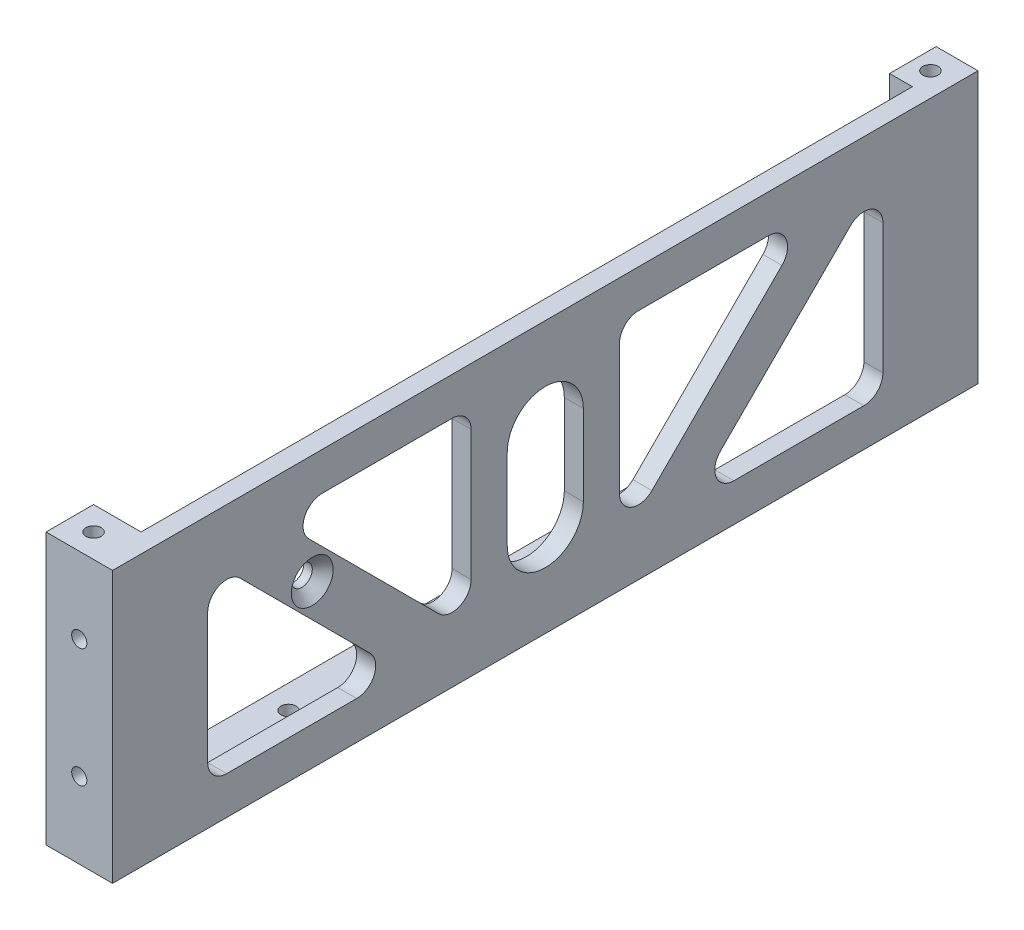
ISO-10303-21;
HEADER;
FILE_DESCRIPTION(('STEP AP214'),'2;1');
FILE_NAME('part.step','',(''),(''),'','','');
FILE_SCHEMA(('AUTOMOTIVE_DESIGN { 1 0 10303 214 1 1 1 1 }'));
ENDSEC;
DATA;
#1=APPLICATION_CONTEXT('core data for automotive mechanical design processes');
#2=APPLICATION_PROTOCOL_DEFINITION('international standard','automotive_design',2000,#1);
#3=PRODUCT_CONTEXT('',#1,'mechanical');
#4=PRODUCT('Part','Part','',(#3));
#5=PRODUCT_RELATED_PRODUCT_CATEGORY('part','',(#4));
#6=PRODUCT_DEFINITION_FORMATION('','',#4);
#7=PRODUCT_DEFINITION_CONTEXT('part definition',#1,'design');
#8=PRODUCT_DEFINITION('design','',#6,#7);
#9=PRODUCT_DEFINITION_SHAPE('','',#8);
#10=(LENGTH_UNIT() NAMED_UNIT(*) SI_UNIT(.MILLI.,.METRE.));
#11=(NAMED_UNIT(*) PLANE_ANGLE_UNIT() SI_UNIT($,.RADIAN.));
#12=(NAMED_UNIT(*) SI_UNIT($,.STERADIAN.) SOLID_ANGLE_UNIT());
#13=UNCERTAINTY_MEASURE_WITH_UNIT(LENGTH_MEASURE(1.E-05),#10,'distance_accuracy_value','');
#14=(GEOMETRIC_REPRESENTATION_CONTEXT(3) GLOBAL_UNCERTAINTY_ASSIGNED_CONTEXT((#13)) GLOBAL_UNIT_ASSIGNED_CONTEXT((#10,
#11,#12)) REPRESENTATION_CONTEXT('',''));
#15=CARTESIAN_POINT('',(0.,0.,0.));
#16=DIRECTION('',(0.,0.,1.));
#17=DIRECTION('',(1.,0.,0.));
#18=AXIS2_PLACEMENT_3D('',#15,#16,#17);
#19=CARTESIAN_POINT('',(0.,0.,0.));
#20=DIRECTION('',(-1.,0.,0.));
#21=DIRECTION('',(0.,0.,1.));
#22=AXIS2_PLACEMENT_3D('',#19,#20,#21);
#23=PLANE('',#22);
#24=CARTESIAN_POINT('',(0.,4.25000000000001,0.));
#25=DIRECTION('',(-1.,0.,0.));
#26=DIRECTION('',(0.,0.,1.));
#27=AXIS2_PLACEMENT_3D('',#24,#25,#26);
#28=CIRCLE('',#27,4.);
#29=CARTESIAN_POINT('',(0.,4.25000000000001,4.));
#30=VERTEX_POINT('',#29);
#31=CARTESIAN_POINT('',(0.,4.25000000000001,-4.));
#32=VERTEX_POINT('',#31);
#33=EDGE_CURVE('E360',#30,#32,#28,.T.);
#34=ORIENTED_EDGE('',*,*,#33,.F.);
#35=DIRECTION('',(0.,1.,0.));
#36=VECTOR('',#35,1.);
#37=CARTESIAN_POINT('',(0.,0.,4.));
#38=LINE('',#37,#36);
#39=CARTESIAN_POINT('',(0.,-4.25,4.));
#40=VERTEX_POINT('',#39);
#41=EDGE_CURVE('E353',#40,#30,#38,.T.);
#42=ORIENTED_EDGE('',*,*,#41,.F.);
#43=CARTESIAN_POINT('',(0.,-4.25,0.));
#44=DIRECTION('',(-1.,0.,0.));
#45=DIRECTION('',(0.,0.,1.));
#46=AXIS2_PLACEMENT_3D('',#43,#44,#45);
#47=CIRCLE('',#46,4.);
#48=CARTESIAN_POINT('',(0.,-4.25,-4.));
#49=VERTEX_POINT('',#48);
#50=EDGE_CURVE('E333',#49,#40,#47,.T.);
#51=ORIENTED_EDGE('',*,*,#50,.F.);
#52=DIRECTION('',(0.,-1.,0.));
#53=VECTOR('',#52,1.);
#54=CARTESIAN_POINT('',(0.,0.,-4.));
#55=LINE('',#54,#53);
#56=EDGE_CURVE('E358',#32,#49,#55,.T.);
#57=ORIENTED_EDGE('',*,*,#56,.F.);
#58=EDGE_LOOP('',(#34,#42,#51,#57));
#59=FACE_BOUND('',#58,.T.);
#60=DIRECTION('',(0.,0.,1.));
#61=VECTOR('',#60,1.);
#62=CARTESIAN_POINT('',(0.,10.25,0.));
#63=LINE('',#62,#61);
#64=CARTESIAN_POINT('',(0.,10.25,-23.4715728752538));
#65=VERTEX_POINT('',#64);
#66=CARTESIAN_POINT('',(0.,10.25,-9.80000000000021));
#67=VERTEX_POINT('',#66);
#68=EDGE_CURVE('E454',#65,#67,#63,.T.);
#69=ORIENTED_EDGE('',*,*,#68,.T.);
#70=CARTESIAN_POINT('',(0.,8.25000000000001,-9.80000000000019));
#71=DIRECTION('',(-1.,0.,0.));
#72=DIRECTION('',(0.,0.,1.));
#73=AXIS2_PLACEMENT_3D('',#70,#71,#72);
#74=CIRCLE('',#73,2.);
#75=CARTESIAN_POINT('',(0.,8.24999999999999,-7.80000000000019));
#76=VERTEX_POINT('',#75);
#77=EDGE_CURVE('E457',#67,#76,#74,.F.);
#78=ORIENTED_EDGE('',*,*,#77,.T.);
#79=DIRECTION('',(0.,-1.,0.));
#80=VECTOR('',#79,1.);
#81=CARTESIAN_POINT('',(0.,0.,-7.80000000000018));
#82=LINE('',#81,#80);
#83=CARTESIAN_POINT('',(0.,-5.42157287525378,-7.80000000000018));
#84=VERTEX_POINT('',#83);
#85=EDGE_CURVE('E432',#76,#84,#82,.T.);
#86=ORIENTED_EDGE('',*,*,#85,.T.);
#87=CARTESIAN_POINT('',(0.,-5.42157287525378,-9.80000000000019));
#88=DIRECTION('',(-1.,0.,0.));
#89=DIRECTION('',(0.,0.,1.));
#90=AXIS2_PLACEMENT_3D('',#87,#88,#89);
#91=CIRCLE('',#90,2.);
#92=CARTESIAN_POINT('',(0.,-6.83578643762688,-11.2142135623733));
#93=VERTEX_POINT('',#92);
#94=EDGE_CURVE('E445',#84,#93,#91,.F.);
#95=ORIENTED_EDGE('',*,*,#94,.T.);
#96=DIRECTION('',(0.,0.707106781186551,-0.707106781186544));
#97=VECTOR('',#96,1.);
#98=CARTESIAN_POINT('',(0.,-9.02500000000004,-9.02500000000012));
#99=LINE('',#98,#97);
#100=CARTESIAN_POINT('',(0.,6.83578643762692,-24.8857864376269));
#101=VERTEX_POINT('',#100);
#102=EDGE_CURVE('E448',#93,#101,#99,.T.);
#103=ORIENTED_EDGE('',*,*,#102,.T.);
#104=CARTESIAN_POINT('',(0.,8.25000000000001,-23.4715728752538));
#105=DIRECTION('',(-1.,0.,0.));
#106=DIRECTION('',(0.,0.,1.));
#107=AXIS2_PLACEMENT_3D('',#104,#105,#106);
#108=CIRCLE('',#107,2.);
#109=EDGE_CURVE('E451',#101,#65,#108,.F.);
#110=ORIENTED_EDGE('',*,*,#109,.T.);
#111=EDGE_LOOP('',(#69,#78,#86,#95,#103,#110));
#112=FACE_BOUND('',#111,.T.);
#113=CARTESIAN_POINT('',(0.,-8.25,19.8284271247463));
#114=DIRECTION('',(-1.,0.,0.));
#115=DIRECTION('',(0.,0.,1.));
#116=AXIS2_PLACEMENT_3D('',#113,#114,#115);
#117=CIRCLE('',#116,2.);
#118=CARTESIAN_POINT('',(0.,-6.83578643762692,18.4142135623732));
#119=VERTEX_POINT('',#118);
#120=CARTESIAN_POINT('',(0.,-10.25,19.8284271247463));
#121=VERTEX_POINT('',#120);
#122=EDGE_CURVE('E501',#119,#121,#117,.T.);
#123=ORIENTED_EDGE('',*,*,#122,.F.);
#124=DIRECTION('',(0.,-0.707106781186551,-0.707106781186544));
#125=VECTOR('',#124,1.);
#126=CARTESIAN_POINT('',(0.,-12.625,12.6250000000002));
#127=LINE('',#126,#125);
#128=CARTESIAN_POINT('',(0.,6.83578643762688,32.0857864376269));
#129=VERTEX_POINT('',#128);
#130=EDGE_CURVE('E480',#129,#119,#127,.T.);
#131=ORIENTED_EDGE('',*,*,#130,.F.);
#132=CARTESIAN_POINT('',(0.,5.42157287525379,33.5));
#133=DIRECTION('',(-1.,0.,0.));
#134=DIRECTION('',(0.,0.,1.));
#135=AXIS2_PLACEMENT_3D('',#132,#133,#134);
#136=CIRCLE('',#135,2.00000000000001);
#137=CARTESIAN_POINT('',(0.,5.42157287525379,35.5));
#138=VERTEX_POINT('',#137);
#139=EDGE_CURVE('E492',#138,#129,#136,.T.);
#140=ORIENTED_EDGE('',*,*,#139,.F.);
#141=DIRECTION('',(0.,1.,0.));
#142=VECTOR('',#141,1.);
#143=CARTESIAN_POINT('',(0.,0.,35.5));
#144=LINE('',#143,#142);
#145=CARTESIAN_POINT('',(0.,-8.24999999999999,35.5));
#146=VERTEX_POINT('',#145);
#147=EDGE_CURVE('E495',#146,#138,#144,.T.);
#148=ORIENTED_EDGE('',*,*,#147,.F.);
#149=CARTESIAN_POINT('',(0.,-8.25,33.5));
#150=DIRECTION('',(-1.,0.,0.));
#151=DIRECTION('',(0.,0.,1.));
#152=AXIS2_PLACEMENT_3D('',#149,#150,#151);
#153=CIRCLE('',#152,2.);
#154=CARTESIAN_POINT('',(0.,-10.25,33.5));
#155=VERTEX_POINT('',#154);
#156=EDGE_CURVE('E497',#155,#146,#153,.T.);
#157=ORIENTED_EDGE('',*,*,#156,.F.);
#158=DIRECTION('',(0.,0.,1.));
#159=VECTOR('',#158,1.);
#160=CARTESIAN_POINT('',(0.,-10.25,0.));
#161=LINE('',#160,#159);
#162=EDGE_CURVE('E499',#121,#155,#161,.T.);
#163=ORIENTED_EDGE('',*,*,#162,.F.);
#164=EDGE_LOOP('',(#123,#131,#140,#148,#157,#163));
#165=FACE_BOUND('',#164,.T.);
#166=CARTESIAN_POINT('',(0.,8.25000000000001,9.80000000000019));
#167=DIRECTION('',(-1.,0.,0.));
#168=DIRECTION('',(0.,0.,1.));
#169=AXIS2_PLACEMENT_3D('',#166,#167,#168);
#170=CIRCLE('',#169,2.);
#171=CARTESIAN_POINT('',(0.,10.25,9.80000000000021));
#172=VERTEX_POINT('',#171);
#173=CARTESIAN_POINT('',(0.,8.24999999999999,7.80000000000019));
#174=VERTEX_POINT('',#173);
#175=EDGE_CURVE('E544',#172,#174,#170,.T.);
#176=ORIENTED_EDGE('',*,*,#175,.F.);
#177=DIRECTION('',(0.,0.,-1.));
#178=VECTOR('',#177,1.);
#179=CARTESIAN_POINT('',(0.,10.25,0.));
#180=LINE('',#179,#178);
#181=CARTESIAN_POINT('',(0.,10.25,23.4715728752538));
#182=VERTEX_POINT('',#181);
#183=EDGE_CURVE('E523',#182,#172,#180,.T.);
#184=ORIENTED_EDGE('',*,*,#183,.F.);
#185=CARTESIAN_POINT('',(0.,8.25000000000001,23.4715728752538));
#186=DIRECTION('',(-1.,0.,0.));
#187=DIRECTION('',(0.,0.,1.));
#188=AXIS2_PLACEMENT_3D('',#185,#186,#187);
#189=CIRCLE('',#188,2.);
#190=CARTESIAN_POINT('',(0.,6.83578643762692,24.8857864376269));
#191=VERTEX_POINT('',#190);
#192=EDGE_CURVE('E535',#191,#182,#189,.T.);
#193=ORIENTED_EDGE('',*,*,#192,.F.);
#194=DIRECTION('',(0.,0.707106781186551,0.707106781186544));
#195=VECTOR('',#194,1.);
#196=CARTESIAN_POINT('',(0.,-9.02500000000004,9.02500000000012));
#197=LINE('',#196,#195);
#198=CARTESIAN_POINT('',(0.,-6.83578643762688,11.2142135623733));
#199=VERTEX_POINT('',#198);
#200=EDGE_CURVE('E538',#199,#191,#197,.T.);
#201=ORIENTED_EDGE('',*,*,#200,.F.);
#202=CARTESIAN_POINT('',(0.,-5.42157287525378,9.80000000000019));
#203=DIRECTION('',(-1.,0.,0.));
#204=DIRECTION('',(0.,0.,1.));
#205=AXIS2_PLACEMENT_3D('',#202,#203,#204);
#206=CIRCLE('',#205,2.);
#207=CARTESIAN_POINT('',(0.,-5.42157287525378,7.80000000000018));
#208=VERTEX_POINT('',#207);
#209=EDGE_CURVE('E540',#208,#199,#206,.T.);
#210=ORIENTED_EDGE('',*,*,#209,.F.);
#211=DIRECTION('',(0.,-1.,0.));
#212=VECTOR('',#211,1.);
#213=CARTESIAN_POINT('',(0.,0.,7.80000000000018));
#214=LINE('',#213,#212);
#215=EDGE_CURVE('E542',#174,#208,#214,.T.);
#216=ORIENTED_EDGE('',*,*,#215,.F.);
#217=EDGE_LOOP('',(#176,#184,#193,#201,#210,#216));
#218=FACE_BOUND('',#217,.T.);
#219=CARTESIAN_POINT('',(0.,2.75,24.5));
#220=DIRECTION('',(-1.,0.,0.));
#221=DIRECTION('',(0.,0.,1.));
#222=AXIS2_PLACEMENT_3D('',#219,#220,#221);
#223=CIRCLE('',#222,1.09999999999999);
#224=CARTESIAN_POINT('',(0.,2.75,25.6));
#225=VERTEX_POINT('',#224);
#226=EDGE_CURVE('E43',#225,#225,#223,.T.);
#227=ORIENTED_EDGE('',*,*,#226,.F.);
#228=EDGE_LOOP('',(#227));
#229=FACE_BOUND('',#228,.T.);
#230=DIRECTION('',(0.,1.,0.));
#231=VECTOR('',#230,1.);
#232=CARTESIAN_POINT('',(0.,-17.25,38.5));
#233=LINE('',#232,#231);
#234=CARTESIAN_POINT('',(0.,-14.25,38.5));
#235=VERTEX_POINT('',#234);
#236=CARTESIAN_POINT('',(0.,-12.25,38.5));
#237=VERTEX_POINT('',#236);
#238=EDGE_CURVE('E607',#235,#237,#233,.T.);
#239=ORIENTED_EDGE('',*,*,#238,.T.);
#240=CARTESIAN_POINT('',(0.,-10.25,38.5));
#241=DIRECTION('',(-1.,0.,0.));
#242=DIRECTION('',(0.,0.,1.));
#243=AXIS2_PLACEMENT_3D('',#240,#241,#242);
#244=CIRCLE('',#243,2.);
#245=CARTESIAN_POINT('',(0.,-10.25,40.5));
#246=VERTEX_POINT('',#245);
#247=EDGE_CURVE('E711',#237,#246,#244,.T.);
#248=ORIENTED_EDGE('',*,*,#247,.T.);
#249=DIRECTION('',(0.,-1.,0.));
#250=VECTOR('',#249,1.);
#251=CARTESIAN_POINT('',(0.,14.25,40.5));
#252=LINE('',#251,#250);
#253=CARTESIAN_POINT('',(0.,14.25,40.5));
#254=VERTEX_POINT('',#253);
#255=EDGE_CURVE('E646',#254,#246,#252,.T.);
#256=ORIENTED_EDGE('',*,*,#255,.F.);
#257=DIRECTION('',(0.,0.,1.));
#258=VECTOR('',#257,1.);
#259=CARTESIAN_POINT('',(0.,14.25,-45.5));
#260=LINE('',#259,#258);
#261=CARTESIAN_POINT('',(0.,14.25,-40.6));
#262=VERTEX_POINT('',#261);
#263=EDGE_CURVE('E676',#262,#254,#260,.T.);
#264=ORIENTED_EDGE('',*,*,#263,.F.);
#265=DIRECTION('',(0.,1.,0.));
#266=VECTOR('',#265,1.);
#267=CARTESIAN_POINT('',(0.,14.25,-40.6));
#268=LINE('',#267,#266);
#269=CARTESIAN_POINT('',(0.,-14.25,-40.6));
#270=VERTEX_POINT('',#269);
#271=EDGE_CURVE('E656',#270,#262,#268,.T.);
#272=ORIENTED_EDGE('',*,*,#271,.F.);
#273=DIRECTION('',(0.,0.,-1.));
#274=VECTOR('',#273,1.);
#275=CARTESIAN_POINT('',(0.,-14.25,-45.5));
#276=LINE('',#275,#274);
#277=CARTESIAN_POINT('',(0.,-14.25,-20.5));
#278=VERTEX_POINT('',#277);
#279=EDGE_CURVE('E686',#278,#270,#276,.T.);
#280=ORIENTED_EDGE('',*,*,#279,.F.);
#281=DIRECTION('',(0.,-1.,0.));
#282=VECTOR('',#281,1.);
#283=CARTESIAN_POINT('',(0.,-14.25,-20.5));
#284=LINE('',#283,#282);
#285=CARTESIAN_POINT('',(0.,-12.25,-20.5));
#286=VERTEX_POINT('',#285);
#287=EDGE_CURVE('E625',#286,#278,#284,.T.);
#288=ORIENTED_EDGE('',*,*,#287,.F.);
#289=DIRECTION('',(0.,0.,-1.));
#290=VECTOR('',#289,1.);
#291=CARTESIAN_POINT('',(0.,-12.25,-20.5));
#292=LINE('',#291,#290);
#293=CARTESIAN_POINT('',(0.,-12.25,36.5));
#294=VERTEX_POINT('',#293);
#295=EDGE_CURVE('E630',#294,#286,#292,.T.);
#296=ORIENTED_EDGE('',*,*,#295,.F.);
#297=DIRECTION('',(0.,1.,0.));
#298=VECTOR('',#297,1.);
#299=CARTESIAN_POINT('',(0.,-17.25,36.5));
#300=LINE('',#299,#298);
#301=CARTESIAN_POINT('',(0.,-14.25,36.5));
#302=VERTEX_POINT('',#301);
#303=EDGE_CURVE('E605',#302,#294,#300,.T.);
#304=ORIENTED_EDGE('',*,*,#303,.F.);
#305=DIRECTION('',(0.,0.,-1.));
#306=VECTOR('',#305,1.);
#307=CARTESIAN_POINT('',(0.,-14.25,-45.5));
#308=LINE('',#307,#306);
#309=EDGE_CURVE('E619',#235,#302,#308,.T.);
#310=ORIENTED_EDGE('',*,*,#309,.F.);
#311=EDGE_LOOP('',(#239,#248,#256,#264,#272,#280,#288,#296,#304,#310));
#312=FACE_BOUND('',#311,.T.);
#313=DIRECTION('',(0.,-0.707106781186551,0.707106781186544));
#314=VECTOR('',#313,1.);
#315=CARTESIAN_POINT('',(0.,-12.625,-12.6250000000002));
#316=LINE('',#315,#314);
#317=CARTESIAN_POINT('',(0.,6.83578643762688,-32.0857864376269));
#318=VERTEX_POINT('',#317);
#319=CARTESIAN_POINT('',(0.,-6.83578643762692,-18.4142135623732));
#320=VERTEX_POINT('',#319);
#321=EDGE_CURVE('E405',#318,#320,#316,.T.);
#322=ORIENTED_EDGE('',*,*,#321,.T.);
#323=CARTESIAN_POINT('',(0.,-8.25,-19.8284271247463));
#324=DIRECTION('',(-1.,0.,0.));
#325=DIRECTION('',(0.,0.,1.));
#326=AXIS2_PLACEMENT_3D('',#323,#324,#325);
#327=CIRCLE('',#326,2.);
#328=CARTESIAN_POINT('',(0.,-10.25,-19.8284271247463));
#329=VERTEX_POINT('',#328);
#330=EDGE_CURVE('E408',#320,#329,#327,.F.);
#331=ORIENTED_EDGE('',*,*,#330,.T.);
#332=DIRECTION('',(0.,0.,-1.));
#333=VECTOR('',#332,1.);
#334=CARTESIAN_POINT('',(0.,-10.25,0.));
#335=LINE('',#334,#333);
#336=CARTESIAN_POINT('',(0.,-10.25,-33.5));
#337=VERTEX_POINT('',#336);
#338=EDGE_CURVE('E383',#329,#337,#335,.T.);
#339=ORIENTED_EDGE('',*,*,#338,.T.);
#340=CARTESIAN_POINT('',(0.,-8.25,-33.5));
#341=DIRECTION('',(-1.,0.,0.));
#342=DIRECTION('',(0.,0.,1.));
#343=AXIS2_PLACEMENT_3D('',#340,#341,#342);
#344=CIRCLE('',#343,2.);
#345=CARTESIAN_POINT('',(0.,-8.24999999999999,-35.5));
#346=VERTEX_POINT('',#345);
#347=EDGE_CURVE('E396',#337,#346,#344,.F.);
#348=ORIENTED_EDGE('',*,*,#347,.T.);
#349=DIRECTION('',(0.,1.,0.));
#350=VECTOR('',#349,1.);
#351=CARTESIAN_POINT('',(0.,0.,-35.5));
#352=LINE('',#351,#350);
#353=CARTESIAN_POINT('',(0.,5.42157287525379,-35.5));
#354=VERTEX_POINT('',#353);
#355=EDGE_CURVE('E399',#346,#354,#352,.T.);
#356=ORIENTED_EDGE('',*,*,#355,.T.);
#357=CARTESIAN_POINT('',(0.,5.42157287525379,-33.5));
#358=DIRECTION('',(-1.,0.,0.));
#359=DIRECTION('',(0.,0.,1.));
#360=AXIS2_PLACEMENT_3D('',#357,#358,#359);
#361=CIRCLE('',#360,2.00000000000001);
#362=EDGE_CURVE('E402',#354,#318,#361,.F.);
#363=ORIENTED_EDGE('',*,*,#362,.T.);
#364=EDGE_LOOP('',(#322,#331,#339,#348,#356,#363));
#365=FACE_BOUND('',#364,.T.);
#366=ADVANCED_FACE('F39',(#59,#112,#165,#218,#229,#312,#365),#23,.T.);
#367=CARTESIAN_POINT('',(2.,0.,0.));
#368=DIRECTION('',(-1.,0.,0.));
#369=DIRECTION('',(0.,0.,1.));
#370=AXIS2_PLACEMENT_3D('',#367,#368,#369);
#371=PLANE('',#370);
#372=DIRECTION('',(0.,-1.,0.));
#373=VECTOR('',#372,1.);
#374=CARTESIAN_POINT('',(2.,4.25000000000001,4.));
#375=LINE('',#374,#373);
#376=CARTESIAN_POINT('',(2.,4.25000000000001,4.));
#377=VERTEX_POINT('',#376);
#378=CARTESIAN_POINT('',(2.,-4.25,4.));
#379=VERTEX_POINT('',#378);
#380=EDGE_CURVE('E339',#377,#379,#375,.T.);
#381=ORIENTED_EDGE('',*,*,#380,.F.);
#382=CARTESIAN_POINT('',(2.,4.25000000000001,0.));
#383=DIRECTION('',(1.,0.,0.));
#384=DIRECTION('',(0.,0.,-1.));
#385=AXIS2_PLACEMENT_3D('',#382,#383,#384);
#386=CIRCLE('',#385,4.);
#387=CARTESIAN_POINT('',(2.,4.25000000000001,-4.));
#388=VERTEX_POINT('',#387);
#389=EDGE_CURVE('E64',#388,#377,#386,.T.);
#390=ORIENTED_EDGE('',*,*,#389,.F.);
#391=DIRECTION('',(0.,1.,0.));
#392=VECTOR('',#391,1.);
#393=CARTESIAN_POINT('',(2.,4.25000000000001,-4.));
#394=LINE('',#393,#392);
#395=CARTESIAN_POINT('',(2.,-4.25,-4.));
#396=VERTEX_POINT('',#395);
#397=EDGE_CURVE('E346',#396,#388,#394,.T.);
#398=ORIENTED_EDGE('',*,*,#397,.F.);
#399=CARTESIAN_POINT('',(2.,-4.25,0.));
#400=DIRECTION('',(1.,0.,0.));
#401=DIRECTION('',(0.,0.,-1.));
#402=AXIS2_PLACEMENT_3D('',#399,#400,#401);
#403=CIRCLE('',#402,4.);
#404=EDGE_CURVE('E330',#379,#396,#403,.T.);
#405=ORIENTED_EDGE('',*,*,#404,.F.);
#406=EDGE_LOOP('',(#381,#390,#398,#405));
#407=FACE_BOUND('',#406,.T.);
#408=CARTESIAN_POINT('',(2.,8.25000000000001,-9.80000000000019));
#409=DIRECTION('',(-1.,0.,0.));
#410=DIRECTION('',(0.,0.,1.));
#411=AXIS2_PLACEMENT_3D('',#408,#409,#410);
#412=CIRCLE('',#411,2.);
#413=CARTESIAN_POINT('',(2.,8.24999999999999,-7.80000000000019));
#414=VERTEX_POINT('',#413);
#415=CARTESIAN_POINT('',(2.,10.25,-9.80000000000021));
#416=VERTEX_POINT('',#415);
#417=EDGE_CURVE('E411',#414,#416,#412,.T.);
#418=ORIENTED_EDGE('',*,*,#417,.T.);
#419=DIRECTION('',(0.,0.,-1.));
#420=VECTOR('',#419,1.);
#421=CARTESIAN_POINT('',(2.,10.25,-9.80000000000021));
#422=LINE('',#421,#420);
#423=CARTESIAN_POINT('',(2.,10.25,-23.4715728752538));
#424=VERTEX_POINT('',#423);
#425=EDGE_CURVE('E426',#416,#424,#422,.T.);
#426=ORIENTED_EDGE('',*,*,#425,.T.);
#427=CARTESIAN_POINT('',(2.,8.25000000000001,-23.4715728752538));
#428=DIRECTION('',(-1.,0.,0.));
#429=DIRECTION('',(0.,0.,-1.));
#430=AXIS2_PLACEMENT_3D('',#427,#428,#429);
#431=CIRCLE('',#430,2.);
#432=CARTESIAN_POINT('',(2.,6.83578643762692,-24.8857864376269));
#433=VERTEX_POINT('',#432);
#434=EDGE_CURVE('E423',#424,#433,#431,.T.);
#435=ORIENTED_EDGE('',*,*,#434,.T.);
#436=DIRECTION('',(0.,-0.707106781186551,0.707106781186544));
#437=VECTOR('',#436,1.);
#438=CARTESIAN_POINT('',(2.,6.83578643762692,-24.8857864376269));
#439=LINE('',#438,#437);
#440=CARTESIAN_POINT('',(2.,-6.83578643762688,-11.2142135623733));
#441=VERTEX_POINT('',#440);
#442=EDGE_CURVE('E420',#433,#441,#439,.T.);
#443=ORIENTED_EDGE('',*,*,#442,.T.);
#444=CARTESIAN_POINT('',(2.,-5.42157287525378,-9.80000000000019));
#445=DIRECTION('',(-1.,0.,0.));
#446=DIRECTION('',(0.,0.,1.));
#447=AXIS2_PLACEMENT_3D('',#444,#445,#446);
#448=CIRCLE('',#447,2.);
#449=CARTESIAN_POINT('',(2.,-5.42157287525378,-7.80000000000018));
#450=VERTEX_POINT('',#449);
#451=EDGE_CURVE('E417',#441,#450,#448,.T.);
#452=ORIENTED_EDGE('',*,*,#451,.T.);
#453=DIRECTION('',(0.,1.,0.));
#454=VECTOR('',#453,1.);
#455=CARTESIAN_POINT('',(2.,-5.42157287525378,-7.80000000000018));
#456=LINE('',#455,#454);
#457=EDGE_CURVE('E414',#450,#414,#456,.T.);
#458=ORIENTED_EDGE('',*,*,#457,.T.);
#459=EDGE_LOOP('',(#418,#426,#435,#443,#452,#458));
#460=FACE_BOUND('',#459,.T.);
#461=DIRECTION('',(0.,0.707106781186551,0.707106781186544));
#462=VECTOR('',#461,1.);
#463=CARTESIAN_POINT('',(2.,-6.83578643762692,18.4142135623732));
#464=LINE('',#463,#462);
#465=CARTESIAN_POINT('',(2.,-6.83578643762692,18.4142135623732));
#466=VERTEX_POINT('',#465);
#467=CARTESIAN_POINT('',(2.,6.83578643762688,32.0857864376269));
#468=VERTEX_POINT('',#467);
#469=EDGE_CURVE('E462',#466,#468,#464,.T.);
#470=ORIENTED_EDGE('',*,*,#469,.F.);
#471=CARTESIAN_POINT('',(2.,-8.25,19.8284271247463));
#472=DIRECTION('',(1.,0.,0.));
#473=DIRECTION('',(0.,0.,-1.));
#474=AXIS2_PLACEMENT_3D('',#471,#472,#473);
#475=CIRCLE('',#474,2.);
#476=CARTESIAN_POINT('',(2.,-10.25,19.8284271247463));
#477=VERTEX_POINT('',#476);
#478=EDGE_CURVE('E460',#477,#466,#475,.T.);
#479=ORIENTED_EDGE('',*,*,#478,.F.);
#480=DIRECTION('',(0.,0.,-1.));
#481=VECTOR('',#480,1.);
#482=CARTESIAN_POINT('',(2.,-10.25,33.5));
#483=LINE('',#482,#481);
#484=CARTESIAN_POINT('',(2.,-10.25,33.5));
#485=VERTEX_POINT('',#484);
#486=EDGE_CURVE('E474',#485,#477,#483,.T.);
#487=ORIENTED_EDGE('',*,*,#486,.F.);
#488=CARTESIAN_POINT('',(2.,-8.25,33.5));
#489=DIRECTION('',(1.,0.,0.));
#490=DIRECTION('',(0.,0.,-1.));
#491=AXIS2_PLACEMENT_3D('',#488,#489,#490);
#492=CIRCLE('',#491,2.);
#493=CARTESIAN_POINT('',(2.,-8.24999999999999,35.5));
#494=VERTEX_POINT('',#493);
#495=EDGE_CURVE('E471',#494,#485,#492,.T.);
#496=ORIENTED_EDGE('',*,*,#495,.F.);
#497=DIRECTION('',(0.,-1.,0.));
#498=VECTOR('',#497,1.);
#499=CARTESIAN_POINT('',(2.,5.42157287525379,35.5));
#500=LINE('',#499,#498);
#501=CARTESIAN_POINT('',(2.,5.42157287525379,35.5));
#502=VERTEX_POINT('',#501);
#503=EDGE_CURVE('E468',#502,#494,#500,.T.);
#504=ORIENTED_EDGE('',*,*,#503,.F.);
#505=CARTESIAN_POINT('',(2.,5.42157287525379,33.5));
#506=DIRECTION('',(1.,0.,0.));
#507=DIRECTION('',(0.,0.,1.));
#508=AXIS2_PLACEMENT_3D('',#505,#506,#507);
#509=CIRCLE('',#508,2.00000000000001);
#510=EDGE_CURVE('E465',#468,#502,#509,.T.);
#511=ORIENTED_EDGE('',*,*,#510,.F.);
#512=EDGE_LOOP('',(#470,#479,#487,#496,#504,#511));
#513=FACE_BOUND('',#512,.T.);
#514=DIRECTION('',(0.,0.,1.));
#515=VECTOR('',#514,1.);
#516=CARTESIAN_POINT('',(2.,10.25,9.80000000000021));
#517=LINE('',#516,#515);
#518=CARTESIAN_POINT('',(2.,10.25,9.80000000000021));
#519=VERTEX_POINT('',#518);
#520=CARTESIAN_POINT('',(2.,10.25,23.4715728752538));
#521=VERTEX_POINT('',#520);
#522=EDGE_CURVE('E505',#519,#521,#517,.T.);
#523=ORIENTED_EDGE('',*,*,#522,.F.);
#524=CARTESIAN_POINT('',(2.,8.25000000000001,9.80000000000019));
#525=DIRECTION('',(1.,0.,0.));
#526=DIRECTION('',(0.,0.,-1.));
#527=AXIS2_PLACEMENT_3D('',#524,#525,#526);
#528=CIRCLE('',#527,2.);
#529=CARTESIAN_POINT('',(2.,8.24999999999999,7.80000000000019));
#530=VERTEX_POINT('',#529);
#531=EDGE_CURVE('E503',#530,#519,#528,.T.);
#532=ORIENTED_EDGE('',*,*,#531,.F.);
#533=DIRECTION('',(0.,1.,0.));
#534=VECTOR('',#533,1.);
#535=CARTESIAN_POINT('',(2.,-5.42157287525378,7.80000000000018));
#536=LINE('',#535,#534);
#537=CARTESIAN_POINT('',(2.,-5.42157287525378,7.80000000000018));
#538=VERTEX_POINT('',#537);
#539=EDGE_CURVE('E517',#538,#530,#536,.T.);
#540=ORIENTED_EDGE('',*,*,#539,.F.);
#541=CARTESIAN_POINT('',(2.,-5.42157287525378,9.80000000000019));
#542=DIRECTION('',(1.,0.,0.));
#543=DIRECTION('',(0.,0.,-1.));
#544=AXIS2_PLACEMENT_3D('',#541,#542,#543);
#545=CIRCLE('',#544,2.);
#546=CARTESIAN_POINT('',(2.,-6.83578643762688,11.2142135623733));
#547=VERTEX_POINT('',#546);
#548=EDGE_CURVE('E514',#547,#538,#545,.T.);
#549=ORIENTED_EDGE('',*,*,#548,.F.);
#550=DIRECTION('',(0.,-0.707106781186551,-0.707106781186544));
#551=VECTOR('',#550,1.);
#552=CARTESIAN_POINT('',(2.,6.83578643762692,24.8857864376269));
#553=LINE('',#552,#551);
#554=CARTESIAN_POINT('',(2.,6.83578643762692,24.8857864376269));
#555=VERTEX_POINT('',#554);
#556=EDGE_CURVE('E511',#555,#547,#553,.T.);
#557=ORIENTED_EDGE('',*,*,#556,.F.);
#558=CARTESIAN_POINT('',(2.,8.25000000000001,23.4715728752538));
#559=DIRECTION('',(1.,0.,0.));
#560=DIRECTION('',(0.,0.,1.));
#561=AXIS2_PLACEMENT_3D('',#558,#559,#560);
#562=CIRCLE('',#561,2.);
#563=EDGE_CURVE('E508',#521,#555,#562,.T.);
#564=ORIENTED_EDGE('',*,*,#563,.F.);
#565=EDGE_LOOP('',(#523,#532,#540,#549,#557,#564));
#566=FACE_BOUND('',#565,.T.);
#567=CARTESIAN_POINT('',(2.,2.75,24.5));
#568=DIRECTION('',(1.,0.,0.));
#569=DIRECTION('',(0.,0.,-1.));
#570=AXIS2_PLACEMENT_3D('',#567,#568,#569);
#571=CIRCLE('',#570,2.2);
#572=CARTESIAN_POINT('',(2.,2.75,22.3));
#573=VERTEX_POINT('',#572);
#574=EDGE_CURVE('E546',#573,#573,#571,.T.);
#575=ORIENTED_EDGE('',*,*,#574,.F.);
#576=EDGE_LOOP('',(#575));
#577=FACE_BOUND('',#576,.T.);
#578=DIRECTION('',(0.,-1.,0.));
#579=VECTOR('',#578,1.);
#580=CARTESIAN_POINT('',(2.,14.25,45.5));
#581=LINE('',#580,#579);
#582=CARTESIAN_POINT('',(2.,14.25,45.5));
#583=VERTEX_POINT('',#582);
#584=CARTESIAN_POINT('',(2.,-14.25,45.5));
#585=VERTEX_POINT('',#584);
#586=EDGE_CURVE('E670',#583,#585,#581,.T.);
#587=ORIENTED_EDGE('',*,*,#586,.T.);
#588=DIRECTION('',(0.,0.,-1.));
#589=VECTOR('',#588,1.);
#590=CARTESIAN_POINT('',(2.,-14.25,-45.5));
#591=LINE('',#590,#589);
#592=CARTESIAN_POINT('',(2.,-14.25,-45.5));
#593=VERTEX_POINT('',#592);
#594=EDGE_CURVE('E1467',#585,#593,#591,.T.);
#595=ORIENTED_EDGE('',*,*,#594,.T.);
#596=DIRECTION('',(0.,1.,0.));
#597=VECTOR('',#596,1.);
#598=CARTESIAN_POINT('',(2.,14.25,-45.5));
#599=LINE('',#598,#597);
#600=CARTESIAN_POINT('',(2.,14.25,-45.5));
#601=VERTEX_POINT('',#600);
#602=EDGE_CURVE('E816',#593,#601,#599,.T.);
#603=ORIENTED_EDGE('',*,*,#602,.T.);
#604=DIRECTION('',(0.,0.,1.));
#605=VECTOR('',#604,1.);
#606=CARTESIAN_POINT('',(2.,14.25,-45.5));
#607=LINE('',#606,#605);
#608=EDGE_CURVE('E695',#601,#583,#607,.T.);
#609=ORIENTED_EDGE('',*,*,#608,.T.);
#610=EDGE_LOOP('',(#587,#595,#603,#609));
#611=FACE_BOUND('',#610,.T.);
#612=CARTESIAN_POINT('',(2.,-8.25,-19.8284271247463));
#613=DIRECTION('',(-1.,0.,0.));
#614=DIRECTION('',(0.,0.,1.));
#615=AXIS2_PLACEMENT_3D('',#612,#613,#614);
#616=CIRCLE('',#615,2.);
#617=CARTESIAN_POINT('',(2.,-10.25,-19.8284271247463));
#618=VERTEX_POINT('',#617);
#619=CARTESIAN_POINT('',(2.,-6.83578643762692,-18.4142135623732));
#620=VERTEX_POINT('',#619);
#621=EDGE_CURVE('E362',#618,#620,#616,.T.);
#622=ORIENTED_EDGE('',*,*,#621,.T.);
#623=DIRECTION('',(0.,0.707106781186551,-0.707106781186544));
#624=VECTOR('',#623,1.);
#625=CARTESIAN_POINT('',(2.,-6.83578643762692,-18.4142135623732));
#626=LINE('',#625,#624);
#627=CARTESIAN_POINT('',(2.,6.83578643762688,-32.0857864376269));
#628=VERTEX_POINT('',#627);
#629=EDGE_CURVE('E377',#620,#628,#626,.T.);
#630=ORIENTED_EDGE('',*,*,#629,.T.);
#631=CARTESIAN_POINT('',(2.,5.42157287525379,-33.5));
#632=DIRECTION('',(-1.,0.,0.));
#633=DIRECTION('',(0.,0.,-1.));
#634=AXIS2_PLACEMENT_3D('',#631,#632,#633);
#635=CIRCLE('',#634,2.00000000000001);
#636=CARTESIAN_POINT('',(2.,5.42157287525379,-35.5));
#637=VERTEX_POINT('',#636);
#638=EDGE_CURVE('E374',#628,#637,#635,.T.);
#639=ORIENTED_EDGE('',*,*,#638,.T.);
#640=DIRECTION('',(0.,-1.,0.));
#641=VECTOR('',#640,1.);
#642=CARTESIAN_POINT('',(2.,5.42157287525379,-35.5));
#643=LINE('',#642,#641);
#644=CARTESIAN_POINT('',(2.,-8.24999999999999,-35.5));
#645=VERTEX_POINT('',#644);
#646=EDGE_CURVE('E371',#637,#645,#643,.T.);
#647=ORIENTED_EDGE('',*,*,#646,.T.);
#648=CARTESIAN_POINT('',(2.,-8.25,-33.5));
#649=DIRECTION('',(-1.,0.,0.));
#650=DIRECTION('',(0.,0.,1.));
#651=AXIS2_PLACEMENT_3D('',#648,#649,#650);
#652=CIRCLE('',#651,2.);
#653=CARTESIAN_POINT('',(2.,-10.25,-33.5));
#654=VERTEX_POINT('',#653);
#655=EDGE_CURVE('E368',#645,#654,#652,.T.);
#656=ORIENTED_EDGE('',*,*,#655,.T.);
#657=DIRECTION('',(0.,0.,1.));
#658=VECTOR('',#657,1.);
#659=CARTESIAN_POINT('',(2.,-10.25,-33.5));
#660=LINE('',#659,#658);
#661=EDGE_CURVE('E365',#654,#618,#660,.T.);
#662=ORIENTED_EDGE('',*,*,#661,.T.);
#663=EDGE_LOOP('',(#622,#630,#639,#647,#656,#662));
#664=FACE_BOUND('',#663,.T.);
#665=ADVANCED_FACE('F343',(#407,#460,#513,#566,#577,#611,#664),#371,.F.);
#666=CARTESIAN_POINT('',(-5.,-12.25,-20.5));
#667=DIRECTION('',(0.,-1.,0.));
#668=DIRECTION('',(0.,0.,-1.));
#669=AXIS2_PLACEMENT_3D('',#666,#667,#668);
#670=PLANE('',#669);
#671=CARTESIAN_POINT('',(-2.5,-12.25,22.5));
#672=DIRECTION('',(0.,-1.,0.));
#673=DIRECTION('',(0.,0.,-1.));
#674=AXIS2_PLACEMENT_3D('',#671,#672,#673);
#675=CIRCLE('',#674,0.799999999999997);
#676=CARTESIAN_POINT('',(-2.5,-12.25,21.7));
#677=VERTEX_POINT('',#676);
#678=EDGE_CURVE('E1530',#677,#677,#675,.T.);
#679=ORIENTED_EDGE('',*,*,#678,.T.);
#680=EDGE_LOOP('',(#679));
#681=FACE_BOUND('',#680,.T.);
#682=CARTESIAN_POINT('',(-2.5,-12.25,-12.5));
#683=DIRECTION('',(0.,-1.,0.));
#684=DIRECTION('',(0.,0.,-1.));
#685=AXIS2_PLACEMENT_3D('',#682,#683,#684);
#686=CIRCLE('',#685,0.799999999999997);
#687=CARTESIAN_POINT('',(-2.5,-12.25,-13.3));
#688=VERTEX_POINT('',#687);
#689=EDGE_CURVE('E1523',#688,#688,#686,.T.);
#690=ORIENTED_EDGE('',*,*,#689,.T.);
#691=EDGE_LOOP('',(#690));
#692=FACE_BOUND('',#691,.T.);
#693=DIRECTION('',(0.,0.,-1.));
#694=VECTOR('',#693,1.);
#695=CARTESIAN_POINT('',(-5.,-12.25,-20.5));
#696=LINE('',#695,#694);
#697=CARTESIAN_POINT('',(-5.,-12.25,34.5));
#698=VERTEX_POINT('',#697);
#699=CARTESIAN_POINT('',(-5.,-12.25,-20.5));
#700=VERTEX_POINT('',#699);
#701=EDGE_CURVE('E641',#698,#700,#696,.T.);
#702=ORIENTED_EDGE('',*,*,#701,.F.);
#703=DIRECTION('',(-1.,0.,0.));
#704=VECTOR('',#703,1.);
#705=CARTESIAN_POINT('',(-5.,-12.25,34.5));
#706=LINE('',#705,#704);
#707=CARTESIAN_POINT('',(-2.00000000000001,-12.25,34.5));
#708=VERTEX_POINT('',#707);
#709=EDGE_CURVE('E599',#708,#698,#706,.T.);
#710=ORIENTED_EDGE('',*,*,#709,.F.);
#711=CARTESIAN_POINT('',(-2.,-12.25,36.5));
#712=DIRECTION('',(0.,1.,0.));
#713=DIRECTION('',(0.,0.,-1.));
#714=AXIS2_PLACEMENT_3D('',#711,#712,#713);
#715=CIRCLE('',#714,2.);
#716=EDGE_CURVE('E596',#294,#708,#715,.T.);
#717=ORIENTED_EDGE('',*,*,#716,.F.);
#718=ORIENTED_EDGE('',*,*,#295,.T.);
#719=DIRECTION('',(1.,0.,0.));
#720=VECTOR('',#719,1.);
#721=CARTESIAN_POINT('',(-5.,-12.25,-20.5));
#722=LINE('',#721,#720);
#723=EDGE_CURVE('E643',#700,#286,#722,.T.);
#724=ORIENTED_EDGE('',*,*,#723,.F.);
#725=EDGE_LOOP('',(#702,#710,#717,#718,#724));
#726=FACE_BOUND('',#725,.T.);
#727=ADVANCED_FACE('F749',(#681,#692,#726),#670,.F.);
#728=CARTESIAN_POINT('',(-5.,0.,0.));
#729=DIRECTION('',(1.,0.,0.));
#730=DIRECTION('',(0.,0.,-1.));
#731=AXIS2_PLACEMENT_3D('',#728,#729,#730);
#732=PLANE('',#731);
#733=DIRECTION('',(0.,-1.,0.));
#734=VECTOR('',#733,1.);
#735=CARTESIAN_POINT('',(-5.,14.25,40.5));
#736=LINE('',#735,#734);
#737=CARTESIAN_POINT('',(-5.,14.25,40.5));
#738=VERTEX_POINT('',#737);
#739=CARTESIAN_POINT('',(-5.,-14.25,40.5));
#740=VERTEX_POINT('',#739);
#741=EDGE_CURVE('E639',#738,#740,#736,.T.);
#742=ORIENTED_EDGE('',*,*,#741,.T.);
#743=DIRECTION('',(0.,0.,1.));
#744=VECTOR('',#743,1.);
#745=CARTESIAN_POINT('',(-5.,-14.25,-20.5));
#746=LINE('',#745,#744);
#747=CARTESIAN_POINT('',(-5.,-14.25,45.5));
#748=VERTEX_POINT('',#747);
#749=EDGE_CURVE('E629',#740,#748,#746,.T.);
#750=ORIENTED_EDGE('',*,*,#749,.T.);
#751=DIRECTION('',(0.,1.,0.));
#752=VECTOR('',#751,1.);
#753=CARTESIAN_POINT('',(-5.,-14.25,45.5));
#754=LINE('',#753,#752);
#755=CARTESIAN_POINT('',(-5.,14.25,45.5));
#756=VERTEX_POINT('',#755);
#757=EDGE_CURVE('E634',#748,#756,#754,.T.);
#758=ORIENTED_EDGE('',*,*,#757,.T.);
#759=DIRECTION('',(0.,0.,-1.));
#760=VECTOR('',#759,1.);
#761=CARTESIAN_POINT('',(-5.,14.25,45.5));
#762=LINE('',#761,#760);
#763=EDGE_CURVE('E637',#756,#738,#762,.T.);
#764=ORIENTED_EDGE('',*,*,#763,.T.);
#765=EDGE_LOOP('',(#742,#750,#758,#764));
#766=FACE_BOUND('',#765,.T.);
#767=ADVANCED_FACE('F768',(#766),#732,.F.);
#768=CARTESIAN_POINT('',(2.,14.25,45.5));
#769=DIRECTION('',(0.,0.,-1.));
#770=DIRECTION('',(-1.,0.,0.));
#771=AXIS2_PLACEMENT_3D('',#768,#769,#770);
#772=PLANE('',#771);
#773=CARTESIAN_POINT('',(-1.5,6.25,45.5));
#774=DIRECTION('',(0.,0.,1.));
#775=DIRECTION('',(1.,0.,0.));
#776=AXIS2_PLACEMENT_3D('',#773,#774,#775);
#777=CIRCLE('',#776,0.79999999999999);
#778=CARTESIAN_POINT('',(-0.70000000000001,6.25,45.5));
#779=VERTEX_POINT('',#778);
#780=EDGE_CURVE('E562',#779,#779,#777,.T.);
#781=ORIENTED_EDGE('',*,*,#780,.F.);
#782=EDGE_LOOP('',(#781));
#783=FACE_BOUND('',#782,.T.);
#784=CARTESIAN_POINT('',(-1.5,-6.25,45.5));
#785=DIRECTION('',(0.,0.,1.));
#786=DIRECTION('',(1.,0.,0.));
#787=AXIS2_PLACEMENT_3D('',#784,#785,#786);
#788=CIRCLE('',#787,0.79999999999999);
#789=CARTESIAN_POINT('',(-0.70000000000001,-6.25,45.5));
#790=VERTEX_POINT('',#789);
#791=EDGE_CURVE('E568',#790,#790,#788,.T.);
#792=ORIENTED_EDGE('',*,*,#791,.F.);
#793=EDGE_LOOP('',(#792));
#794=FACE_BOUND('',#793,.T.);
#795=DIRECTION('',(-1.,0.,0.));
#796=VECTOR('',#795,1.);
#797=CARTESIAN_POINT('',(2.,14.25,45.5));
#798=LINE('',#797,#796);
#799=EDGE_CURVE('E699',#583,#756,#798,.T.);
#800=ORIENTED_EDGE('',*,*,#799,.T.);
#801=ORIENTED_EDGE('',*,*,#757,.F.);
#802=DIRECTION('',(-1.,0.,0.));
#803=VECTOR('',#802,1.);
#804=CARTESIAN_POINT('',(2.,-14.25,45.5));
#805=LINE('',#804,#803);
#806=EDGE_CURVE('E704',#585,#748,#805,.T.);
#807=ORIENTED_EDGE('',*,*,#806,.F.);
#808=ORIENTED_EDGE('',*,*,#586,.F.);
#809=EDGE_LOOP('',(#800,#801,#807,#808));
#810=FACE_BOUND('',#809,.T.);
#811=ADVANCED_FACE('F765',(#783,#794,#810),#772,.F.);
#812=CARTESIAN_POINT('',(2.,-14.25,-45.5));
#813=DIRECTION('',(0.,1.,0.));
#814=DIRECTION('',(0.,0.,1.));
#815=AXIS2_PLACEMENT_3D('',#812,#813,#814);
#816=PLANE('',#815);
#817=CARTESIAN_POINT('',(-2.5,-14.25,22.5));
#818=DIRECTION('',(0.,-1.,0.));
#819=DIRECTION('',(0.,0.,-1.));
#820=AXIS2_PLACEMENT_3D('',#817,#818,#819);
#821=CIRCLE('',#820,0.799999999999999);
#822=CARTESIAN_POINT('',(-2.5,-14.25,21.7));
#823=VERTEX_POINT('',#822);
#824=EDGE_CURVE('E1533',#823,#823,#821,.T.);
#825=ORIENTED_EDGE('',*,*,#824,.F.);
#826=EDGE_LOOP('',(#825));
#827=FACE_BOUND('',#826,.T.);
#828=CARTESIAN_POINT('',(-2.5,-14.25,-12.5));
#829=DIRECTION('',(0.,-1.,0.));
#830=DIRECTION('',(0.,0.,-1.));
#831=AXIS2_PLACEMENT_3D('',#828,#829,#830);
#832=CIRCLE('',#831,0.799999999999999);
#833=CARTESIAN_POINT('',(-2.5,-14.25,-13.3));
#834=VERTEX_POINT('',#833);
#835=EDGE_CURVE('E1525',#834,#834,#832,.T.);
#836=ORIENTED_EDGE('',*,*,#835,.F.);
#837=EDGE_LOOP('',(#836));
#838=FACE_BOUND('',#837,.T.);
#839=CARTESIAN_POINT('',(-2.5,-14.25,43.));
#840=DIRECTION('',(0.,-1.,0.));
#841=DIRECTION('',(0.,0.,-1.));
#842=AXIS2_PLACEMENT_3D('',#839,#840,#841);
#843=CIRCLE('',#842,0.79999999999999);
#844=CARTESIAN_POINT('',(-2.5,-14.25,42.2));
#845=VERTEX_POINT('',#844);
#846=EDGE_CURVE('E584',#845,#845,#843,.T.);
#847=ORIENTED_EDGE('',*,*,#846,.F.);
#848=EDGE_LOOP('',(#847));
#849=FACE_BOUND('',#848,.T.);
#850=CARTESIAN_POINT('',(-0.5,-14.25,-43.));
#851=DIRECTION('',(0.,-1.,0.));
#852=DIRECTION('',(0.,0.,-1.));
#853=AXIS2_PLACEMENT_3D('',#850,#851,#852);
#854=CIRCLE('',#853,0.79999999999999);
#855=CARTESIAN_POINT('',(-0.5,-14.25,-43.8));
#856=VERTEX_POINT('',#855);
#857=EDGE_CURVE('E590',#856,#856,#854,.T.);
#858=ORIENTED_EDGE('',*,*,#857,.F.);
#859=EDGE_LOOP('',(#858));
#860=FACE_BOUND('',#859,.T.);
#861=ORIENTED_EDGE('',*,*,#749,.F.);
#862=DIRECTION('',(1.,0.,0.));
#863=VECTOR('',#862,1.);
#864=CARTESIAN_POINT('',(2.,-14.25,40.5));
#865=LINE('',#864,#863);
#866=CARTESIAN_POINT('',(-2.00000000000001,-14.25,40.5));
#867=VERTEX_POINT('',#866);
#868=EDGE_CURVE('E613',#740,#867,#865,.T.);
#869=ORIENTED_EDGE('',*,*,#868,.T.);
#870=CARTESIAN_POINT('',(-2.,-14.25,38.5));
#871=DIRECTION('',(0.,1.,0.));
#872=DIRECTION('',(0.,0.,1.));
#873=AXIS2_PLACEMENT_3D('',#870,#871,#872);
#874=CIRCLE('',#873,2.);
#875=EDGE_CURVE('E616',#867,#235,#874,.T.);
#876=ORIENTED_EDGE('',*,*,#875,.T.);
#877=ORIENTED_EDGE('',*,*,#309,.T.);
#878=CARTESIAN_POINT('',(-2.,-14.25,36.5));
#879=DIRECTION('',(0.,1.,0.));
#880=DIRECTION('',(0.,0.,1.));
#881=AXIS2_PLACEMENT_3D('',#878,#879,#880);
#882=CIRCLE('',#881,2.);
#883=CARTESIAN_POINT('',(-2.00000000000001,-14.25,34.5));
#884=VERTEX_POINT('',#883);
#885=EDGE_CURVE('E622',#302,#884,#882,.T.);
#886=ORIENTED_EDGE('',*,*,#885,.T.);
#887=DIRECTION('',(-1.,0.,0.));
#888=VECTOR('',#887,1.);
#889=CARTESIAN_POINT('',(2.,-14.25,34.5));
#890=LINE('',#889,#888);
#891=CARTESIAN_POINT('',(-5.,-14.25,34.5));
#892=VERTEX_POINT('',#891);
#893=EDGE_CURVE('E604',#884,#892,#890,.T.);
#894=ORIENTED_EDGE('',*,*,#893,.T.);
#895=CARTESIAN_POINT('',(-5.,-14.25,-20.5));
#896=VERTEX_POINT('',#895);
#897=EDGE_CURVE('E631',#896,#892,#746,.T.);
#898=ORIENTED_EDGE('',*,*,#897,.F.);
#899=DIRECTION('',(1.,0.,0.));
#900=VECTOR('',#899,1.);
#901=CARTESIAN_POINT('',(-5.,-14.25,-20.5));
#902=LINE('',#901,#900);
#903=EDGE_CURVE('E654',#896,#278,#902,.T.);
#904=ORIENTED_EDGE('',*,*,#903,.T.);
#905=ORIENTED_EDGE('',*,*,#279,.T.);
#906=DIRECTION('',(1.,0.,0.));
#907=VECTOR('',#906,1.);
#908=CARTESIAN_POINT('',(-2.4,-14.25,-40.6));
#909=LINE('',#908,#907);
#910=CARTESIAN_POINT('',(-2.4,-14.25,-40.6));
#911=VERTEX_POINT('',#910);
#912=EDGE_CURVE('E681',#911,#270,#909,.T.);
#913=ORIENTED_EDGE('',*,*,#912,.F.);
#914=DIRECTION('',(0.,0.,1.));
#915=VECTOR('',#914,1.);
#916=CARTESIAN_POINT('',(-2.4,-14.25,-45.5));
#917=LINE('',#916,#915);
#918=CARTESIAN_POINT('',(-2.4,-14.25,-45.5));
#919=VERTEX_POINT('',#918);
#920=EDGE_CURVE('E660',#919,#911,#917,.T.);
#921=ORIENTED_EDGE('',*,*,#920,.F.);
#922=DIRECTION('',(-1.,0.,0.));
#923=VECTOR('',#922,1.);
#924=CARTESIAN_POINT('',(2.,-14.25,-45.5));
#925=LINE('',#924,#923);
#926=EDGE_CURVE('E703',#593,#919,#925,.T.);
#927=ORIENTED_EDGE('',*,*,#926,.F.);
#928=ORIENTED_EDGE('',*,*,#594,.F.);
#929=ORIENTED_EDGE('',*,*,#806,.T.);
#930=EDGE_LOOP('',(#861,#869,#876,#877,#886,#894,#898,#904,#905,#913,#921,#927,#928,#929));
#931=FACE_BOUND('',#930,.T.);
#932=ADVANCED_FACE('F762',(#827,#838,#849,#860,#931),#816,.F.);
#933=CARTESIAN_POINT('',(2.,14.25,-45.5));
#934=DIRECTION('',(0.,0.,1.));
#935=DIRECTION('',(1.,0.,0.));
#936=AXIS2_PLACEMENT_3D('',#933,#934,#935);
#937=PLANE('',#936);
#938=CARTESIAN_POINT('',(-1.,6.25000000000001,-45.5));
#939=DIRECTION('',(0.,0.,-1.));
#940=DIRECTION('',(-1.,0.,0.));
#941=AXIS2_PLACEMENT_3D('',#938,#939,#940);
#942=CIRCLE('',#941,0.79999999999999);
#943=CARTESIAN_POINT('',(-1.79999999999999,6.25000000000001,-45.5));
#944=VERTEX_POINT('',#943);
#945=EDGE_CURVE('E552',#944,#944,#942,.T.);
#946=ORIENTED_EDGE('',*,*,#945,.F.);
#947=EDGE_LOOP('',(#946));
#948=FACE_BOUND('',#947,.T.);
#949=CARTESIAN_POINT('',(-1.,-6.25,-45.5));
#950=DIRECTION('',(0.,0.,-1.));
#951=DIRECTION('',(-1.,0.,0.));
#952=AXIS2_PLACEMENT_3D('',#949,#950,#951);
#953=CIRCLE('',#952,0.79999999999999);
#954=CARTESIAN_POINT('',(-1.79999999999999,-6.25,-45.5));
#955=VERTEX_POINT('',#954);
#956=EDGE_CURVE('E556',#955,#955,#953,.T.);
#957=ORIENTED_EDGE('',*,*,#956,.F.);
#958=EDGE_LOOP('',(#957));
#959=FACE_BOUND('',#958,.T.);
#960=ORIENTED_EDGE('',*,*,#926,.T.);
#961=DIRECTION('',(0.,-1.,0.));
#962=VECTOR('',#961,1.);
#963=CARTESIAN_POINT('',(-2.4,14.25,-45.5));
#964=LINE('',#963,#962);
#965=CARTESIAN_POINT('',(-2.4,14.25,-45.5));
#966=VERTEX_POINT('',#965);
#967=EDGE_CURVE('E657',#966,#919,#964,.T.);
#968=ORIENTED_EDGE('',*,*,#967,.F.);
#969=DIRECTION('',(-1.,0.,0.));
#970=VECTOR('',#969,1.);
#971=CARTESIAN_POINT('',(2.,14.25,-45.5));
#972=LINE('',#971,#970);
#973=EDGE_CURVE('E701',#601,#966,#972,.T.);
#974=ORIENTED_EDGE('',*,*,#973,.F.);
#975=ORIENTED_EDGE('',*,*,#602,.F.);
#976=EDGE_LOOP('',(#960,#968,#974,#975));
#977=FACE_BOUND('',#976,.T.);
#978=ADVANCED_FACE('F758',(#948,#959,#977),#937,.F.);
#979=CARTESIAN_POINT('',(2.,14.25,-45.5));
#980=DIRECTION('',(0.,-1.,0.));
#981=DIRECTION('',(0.,0.,-1.));
#982=AXIS2_PLACEMENT_3D('',#979,#980,#981);
#983=PLANE('',#982);
#984=CARTESIAN_POINT('',(-2.5,14.25,43.));
#985=DIRECTION('',(0.,1.,0.));
#986=DIRECTION('',(0.,0.,1.));
#987=AXIS2_PLACEMENT_3D('',#984,#985,#986);
#988=CIRCLE('',#987,0.79999999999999);
#989=CARTESIAN_POINT('',(-2.5,14.25,43.8));
#990=VERTEX_POINT('',#989);
#991=EDGE_CURVE('E572',#990,#990,#988,.T.);
#992=ORIENTED_EDGE('',*,*,#991,.F.);
#993=EDGE_LOOP('',(#992));
#994=FACE_BOUND('',#993,.T.);
#995=CARTESIAN_POINT('',(-0.5,14.25,-43.));
#996=DIRECTION('',(0.,1.,0.));
#997=DIRECTION('',(0.,0.,1.));
#998=AXIS2_PLACEMENT_3D('',#995,#996,#997);
#999=CIRCLE('',#998,0.79999999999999);
#1000=CARTESIAN_POINT('',(-0.5,14.25,-42.2));
#1001=VERTEX_POINT('',#1000);
#1002=EDGE_CURVE('E578',#1001,#1001,#999,.T.);
#1003=ORIENTED_EDGE('',*,*,#1002,.F.);
#1004=EDGE_LOOP('',(#1003));
#1005=FACE_BOUND('',#1004,.T.);
#1006=ORIENTED_EDGE('',*,*,#973,.T.);
#1007=DIRECTION('',(0.,0.,-1.));
#1008=VECTOR('',#1007,1.);
#1009=CARTESIAN_POINT('',(-2.4,14.25,-45.5));
#1010=LINE('',#1009,#1008);
#1011=CARTESIAN_POINT('',(-2.4,14.25,-40.6));
#1012=VERTEX_POINT('',#1011);
#1013=EDGE_CURVE('E664',#1012,#966,#1010,.T.);
#1014=ORIENTED_EDGE('',*,*,#1013,.F.);
#1015=DIRECTION('',(1.,0.,0.));
#1016=VECTOR('',#1015,1.);
#1017=CARTESIAN_POINT('',(-2.4,14.25,-40.6));
#1018=LINE('',#1017,#1016);
#1019=EDGE_CURVE('E667',#1012,#262,#1018,.T.);
#1020=ORIENTED_EDGE('',*,*,#1019,.T.);
#1021=ORIENTED_EDGE('',*,*,#263,.T.);
#1022=DIRECTION('',(1.,0.,0.));
#1023=VECTOR('',#1022,1.);
#1024=CARTESIAN_POINT('',(-5.,14.25,40.5));
#1025=LINE('',#1024,#1023);
#1026=EDGE_CURVE('E652',#738,#254,#1025,.T.);
#1027=ORIENTED_EDGE('',*,*,#1026,.F.);
#1028=ORIENTED_EDGE('',*,*,#763,.F.);
#1029=ORIENTED_EDGE('',*,*,#799,.F.);
#1030=ORIENTED_EDGE('',*,*,#608,.F.);
#1031=EDGE_LOOP('',(#1006,#1014,#1020,#1021,#1027,#1028,#1029,#1030));
#1032=FACE_BOUND('',#1031,.T.);
#1033=ADVANCED_FACE('F755',(#994,#1005,#1032),#983,.F.);
#1034=CARTESIAN_POINT('',(-2.4,14.25,-40.6));
#1035=DIRECTION('',(0.,0.,-1.));
#1036=DIRECTION('',(-1.,0.,0.));
#1037=AXIS2_PLACEMENT_3D('',#1034,#1035,#1036);
#1038=PLANE('',#1037);
#1039=CARTESIAN_POINT('',(-1.,6.25000000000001,-40.6));
#1040=DIRECTION('',(0.,0.,-1.));
#1041=DIRECTION('',(-1.,0.,0.));
#1042=AXIS2_PLACEMENT_3D('',#1039,#1040,#1041);
#1043=CIRCLE('',#1042,0.799999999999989);
#1044=CARTESIAN_POINT('',(-1.79999999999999,6.25000000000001,-40.6));
#1045=VERTEX_POINT('',#1044);
#1046=EDGE_CURVE('E555',#1045,#1045,#1043,.T.);
#1047=ORIENTED_EDGE('',*,*,#1046,.T.);
#1048=EDGE_LOOP('',(#1047));
#1049=FACE_BOUND('',#1048,.T.);
#1050=CARTESIAN_POINT('',(-1.,-6.25,-40.6));
#1051=DIRECTION('',(0.,0.,-1.));
#1052=DIRECTION('',(-1.,0.,0.));
#1053=AXIS2_PLACEMENT_3D('',#1050,#1051,#1052);
#1054=CIRCLE('',#1053,0.799999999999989);
#1055=CARTESIAN_POINT('',(-1.79999999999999,-6.25,-40.6));
#1056=VERTEX_POINT('',#1055);
#1057=EDGE_CURVE('E559',#1056,#1056,#1054,.T.);
#1058=ORIENTED_EDGE('',*,*,#1057,.T.);
#1059=EDGE_LOOP('',(#1058));
#1060=FACE_BOUND('',#1059,.T.);
#1061=ORIENTED_EDGE('',*,*,#271,.T.);
#1062=ORIENTED_EDGE('',*,*,#1019,.F.);
#1063=DIRECTION('',(0.,1.,0.));
#1064=VECTOR('',#1063,1.);
#1065=CARTESIAN_POINT('',(-2.4,14.25,-40.6));
#1066=LINE('',#1065,#1064);
#1067=EDGE_CURVE('E662',#911,#1012,#1066,.T.);
#1068=ORIENTED_EDGE('',*,*,#1067,.F.);
#1069=ORIENTED_EDGE('',*,*,#912,.T.);
#1070=EDGE_LOOP('',(#1061,#1062,#1068,#1069));
#1071=FACE_BOUND('',#1070,.T.);
#1072=ADVANCED_FACE('F724',(#1049,#1060,#1071),#1038,.F.);
#1073=CARTESIAN_POINT('',(-2.4,0.,0.));
#1074=DIRECTION('',(-1.,0.,0.));
#1075=DIRECTION('',(0.,0.,1.));
#1076=AXIS2_PLACEMENT_3D('',#1073,#1074,#1075);
#1077=PLANE('',#1076);
#1078=ORIENTED_EDGE('',*,*,#967,.T.);
#1079=ORIENTED_EDGE('',*,*,#920,.T.);
#1080=ORIENTED_EDGE('',*,*,#1067,.T.);
#1081=ORIENTED_EDGE('',*,*,#1013,.T.);
#1082=EDGE_LOOP('',(#1078,#1079,#1080,#1081));
#1083=FACE_BOUND('',#1082,.T.);
#1084=ADVANCED_FACE('F811',(#1083),#1077,.T.);
#1085=CARTESIAN_POINT('',(-5.,-14.25,-20.5));
#1086=DIRECTION('',(0.,0.,1.));
#1087=DIRECTION('',(0.,-1.,0.));
#1088=AXIS2_PLACEMENT_3D('',#1085,#1086,#1087);
#1089=PLANE('',#1088);
#1090=ORIENTED_EDGE('',*,*,#287,.T.);
#1091=ORIENTED_EDGE('',*,*,#903,.F.);
#1092=DIRECTION('',(0.,-1.,0.));
#1093=VECTOR('',#1092,1.);
#1094=CARTESIAN_POINT('',(-5.,-14.25,-20.5));
#1095=LINE('',#1094,#1093);
#1096=EDGE_CURVE('E626',#700,#896,#1095,.T.);
#1097=ORIENTED_EDGE('',*,*,#1096,.F.);
#1098=ORIENTED_EDGE('',*,*,#723,.T.);
#1099=EDGE_LOOP('',(#1090,#1091,#1097,#1098));
#1100=FACE_BOUND('',#1099,.T.);
#1101=ADVANCED_FACE('F821',(#1100),#1089,.F.);
#1102=CARTESIAN_POINT('',(-5.,14.25,40.5));
#1103=DIRECTION('',(0.,0.,1.));
#1104=DIRECTION('',(1.,0.,0.));
#1105=AXIS2_PLACEMENT_3D('',#1102,#1103,#1104);
#1106=PLANE('',#1105);
#1107=CARTESIAN_POINT('',(-1.5,6.25,40.5));
#1108=DIRECTION('',(0.,0.,1.));
#1109=DIRECTION('',(1.,0.,0.));
#1110=AXIS2_PLACEMENT_3D('',#1107,#1108,#1109);
#1111=CIRCLE('',#1110,0.799999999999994);
#1112=CARTESIAN_POINT('',(-0.700000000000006,6.25,40.5));
#1113=VERTEX_POINT('',#1112);
#1114=EDGE_CURVE('E565',#1113,#1113,#1111,.T.);
#1115=ORIENTED_EDGE('',*,*,#1114,.T.);
#1116=EDGE_LOOP('',(#1115));
#1117=FACE_BOUND('',#1116,.T.);
#1118=CARTESIAN_POINT('',(-1.5,-6.25,40.5));
#1119=DIRECTION('',(0.,0.,1.));
#1120=DIRECTION('',(1.,0.,0.));
#1121=AXIS2_PLACEMENT_3D('',#1118,#1119,#1120);
#1122=CIRCLE('',#1121,0.799999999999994);
#1123=CARTESIAN_POINT('',(-0.700000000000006,-6.25,40.5));
#1124=VERTEX_POINT('',#1123);
#1125=EDGE_CURVE('E571',#1124,#1124,#1122,.T.);
#1126=ORIENTED_EDGE('',*,*,#1125,.T.);
#1127=EDGE_LOOP('',(#1126));
#1128=FACE_BOUND('',#1127,.T.);
#1129=ORIENTED_EDGE('',*,*,#255,.T.);
#1130=DIRECTION('',(1.,0.,0.));
#1131=VECTOR('',#1130,1.);
#1132=CARTESIAN_POINT('',(-2.00000000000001,-10.25,40.5));
#1133=LINE('',#1132,#1131);
#1134=CARTESIAN_POINT('',(-2.00000000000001,-10.25,40.5));
#1135=VERTEX_POINT('',#1134);
#1136=EDGE_CURVE('E48',#246,#1135,#1133,.F.);
#1137=ORIENTED_EDGE('',*,*,#1136,.T.);
#1138=DIRECTION('',(0.,1.,0.));
#1139=VECTOR('',#1138,1.);
#1140=CARTESIAN_POINT('',(-2.00000000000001,-17.25,40.5));
#1141=LINE('',#1140,#1139);
#1142=EDGE_CURVE('E601',#867,#1135,#1141,.T.);
#1143=ORIENTED_EDGE('',*,*,#1142,.F.);
#1144=ORIENTED_EDGE('',*,*,#868,.F.);
#1145=ORIENTED_EDGE('',*,*,#741,.F.);
#1146=ORIENTED_EDGE('',*,*,#1026,.T.);
#1147=EDGE_LOOP('',(#1129,#1137,#1143,#1144,#1145,#1146));
#1148=FACE_BOUND('',#1147,.T.);
#1149=ADVANCED_FACE('F791',(#1117,#1128,#1148),#1106,.F.);
#1150=ORIENTED_EDGE('',*,*,#897,.T.);
#1151=DIRECTION('',(0.,1.,0.));
#1152=VECTOR('',#1151,1.);
#1153=CARTESIAN_POINT('',(-5.,0.,34.5));
#1154=LINE('',#1153,#1152);
#1155=EDGE_CURVE('E691',#892,#698,#1154,.T.);
#1156=ORIENTED_EDGE('',*,*,#1155,.T.);
#1157=ORIENTED_EDGE('',*,*,#701,.T.);
#1158=ORIENTED_EDGE('',*,*,#1096,.T.);
#1159=EDGE_LOOP('',(#1150,#1156,#1157,#1158));
#1160=FACE_BOUND('',#1159,.T.);
#1161=ADVANCED_FACE('F775',(#1160),#732,.F.);
#1162=CARTESIAN_POINT('',(-2.,-17.25,36.5));
#1163=DIRECTION('',(0.,1.,0.));
#1164=DIRECTION('',(0.,0.,1.));
#1165=AXIS2_PLACEMENT_3D('',#1162,#1163,#1164);
#1166=CYLINDRICAL_SURFACE('',#1165,2.);
#1167=ORIENTED_EDGE('',*,*,#303,.T.);
#1168=ORIENTED_EDGE('',*,*,#716,.T.);
#1169=DIRECTION('',(0.,1.,0.));
#1170=VECTOR('',#1169,1.);
#1171=CARTESIAN_POINT('',(-2.00000000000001,-17.25,34.5));
#1172=LINE('',#1171,#1170);
#1173=EDGE_CURVE('E602',#884,#708,#1172,.T.);
#1174=ORIENTED_EDGE('',*,*,#1173,.F.);
#1175=ORIENTED_EDGE('',*,*,#885,.F.);
#1176=EDGE_LOOP('',(#1167,#1168,#1174,#1175));
#1177=FACE_BOUND('',#1176,.T.);
#1178=ADVANCED_FACE('F829',(#1177),#1166,.F.);
#1179=CARTESIAN_POINT('',(-2.,-17.25,38.5));
#1180=DIRECTION('',(0.,1.,0.));
#1181=DIRECTION('',(0.,0.,1.));
#1182=AXIS2_PLACEMENT_3D('',#1179,#1180,#1181);
#1183=CYLINDRICAL_SURFACE('',#1182,2.);
#1184=ORIENTED_EDGE('',*,*,#1142,.T.);
#1185=CARTESIAN_POINT('',(-2.,-10.25,38.5));
#1186=DIRECTION('',(0.707106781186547,0.707106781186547,0.));
#1187=DIRECTION('',(-0.707106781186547,0.707106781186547,0.));
#1188=AXIS2_PLACEMENT_3D('',#1185,#1186,#1187);
#1189=ELLIPSE('',#1188,2.82842712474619,2.);
#1190=EDGE_CURVE('E11',#1135,#237,#1189,.T.);
#1191=ORIENTED_EDGE('',*,*,#1190,.T.);
#1192=ORIENTED_EDGE('',*,*,#238,.F.);
#1193=ORIENTED_EDGE('',*,*,#875,.F.);
#1194=EDGE_LOOP('',(#1184,#1191,#1192,#1193));
#1195=FACE_BOUND('',#1194,.T.);
#1196=ADVANCED_FACE('F795',(#1195),#1183,.F.);
#1197=CARTESIAN_POINT('',(-5.,-17.25,34.5));
#1198=DIRECTION('',(0.,0.,-1.));
#1199=DIRECTION('',(-1.,0.,0.));
#1200=AXIS2_PLACEMENT_3D('',#1197,#1198,#1199);
#1201=PLANE('',#1200);
#1202=ORIENTED_EDGE('',*,*,#1173,.T.);
#1203=ORIENTED_EDGE('',*,*,#709,.T.);
#1204=ORIENTED_EDGE('',*,*,#1155,.F.);
#1205=ORIENTED_EDGE('',*,*,#893,.F.);
#1206=EDGE_LOOP('',(#1202,#1203,#1204,#1205));
#1207=FACE_BOUND('',#1206,.T.);
#1208=ADVANCED_FACE('F1290',(#1207),#1201,.F.);
#1209=CARTESIAN_POINT('',(-5.,-10.25,38.5));
#1210=DIRECTION('',(-1.,0.,0.));
#1211=DIRECTION('',(0.,0.,1.));
#1212=AXIS2_PLACEMENT_3D('',#1209,#1210,#1211);
#1213=CYLINDRICAL_SURFACE('',#1212,2.);
#1214=ORIENTED_EDGE('',*,*,#1190,.F.);
#1215=ORIENTED_EDGE('',*,*,#1136,.F.);
#1216=ORIENTED_EDGE('',*,*,#247,.F.);
#1217=EDGE_LOOP('',(#1214,#1215,#1216));
#1218=FACE_BOUND('',#1217,.T.);
#1219=ADVANCED_FACE('F41',(#1218),#1213,.F.);
#1220=CARTESIAN_POINT('',(-0.5,-9.05,-43.));
#1221=DIRECTION('',(0.,-1.,0.));
#1222=DIRECTION('',(0.,0.,-1.));
#1223=AXIS2_PLACEMENT_3D('',#1220,#1221,#1222);
#1224=CONICAL_SURFACE('',#1223,0.799999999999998,1.02974425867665);
#1225=CARTESIAN_POINT('',(-0.500000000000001,-8.56931150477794,-43.));
#1226=VERTEX_POINT('',#1225);
#1227=VERTEX_LOOP('',#1226);
#1228=FACE_BOUND('',#1227,.T.);
#1229=CARTESIAN_POINT('',(-0.5,-9.05,-43.));
#1230=DIRECTION('',(0.,-1.,0.));
#1231=DIRECTION('',(0.,0.,-1.));
#1232=AXIS2_PLACEMENT_3D('',#1229,#1230,#1231);
#1233=CIRCLE('',#1232,0.799999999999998);
#1234=CARTESIAN_POINT('',(-0.5,-9.05,-43.8));
#1235=VERTEX_POINT('',#1234);
#1236=EDGE_CURVE('E593',#1235,#1235,#1233,.T.);
#1237=ORIENTED_EDGE('',*,*,#1236,.T.);
#1238=EDGE_LOOP('',(#1237));
#1239=FACE_BOUND('',#1238,.T.);
#1240=ADVANCED_FACE('F1238',(#1228,#1239),#1224,.F.);
#1241=CARTESIAN_POINT('',(-0.5,-14.25,-43.));
#1242=DIRECTION('',(0.,-1.,0.));
#1243=DIRECTION('',(0.,0.,-1.));
#1244=AXIS2_PLACEMENT_3D('',#1241,#1242,#1243);
#1245=CYLINDRICAL_SURFACE('',#1244,0.799999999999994);
#1246=ORIENTED_EDGE('',*,*,#1236,.F.);
#1247=EDGE_LOOP('',(#1246));
#1248=FACE_BOUND('',#1247,.T.);
#1249=ORIENTED_EDGE('',*,*,#857,.T.);
#1250=EDGE_LOOP('',(#1249));
#1251=FACE_BOUND('',#1250,.T.);
#1252=ADVANCED_FACE('F1235',(#1248,#1251),#1245,.F.);
#1253=CARTESIAN_POINT('',(-2.5,-9.05,43.));
#1254=DIRECTION('',(0.,-1.,0.));
#1255=DIRECTION('',(0.,0.,-1.));
#1256=AXIS2_PLACEMENT_3D('',#1253,#1254,#1255);
#1257=CONICAL_SURFACE('',#1256,0.799999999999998,1.02974425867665);
#1258=CARTESIAN_POINT('',(-2.5,-8.56931150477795,43.));
#1259=VERTEX_POINT('',#1258);
#1260=VERTEX_LOOP('',#1259);
#1261=FACE_BOUND('',#1260,.T.);
#1262=CARTESIAN_POINT('',(-2.5,-9.05,43.));
#1263=DIRECTION('',(0.,-1.,0.));
#1264=DIRECTION('',(0.,0.,-1.));
#1265=AXIS2_PLACEMENT_3D('',#1262,#1263,#1264);
#1266=CIRCLE('',#1265,0.799999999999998);
#1267=CARTESIAN_POINT('',(-2.5,-9.05,42.2));
#1268=VERTEX_POINT('',#1267);
#1269=EDGE_CURVE('E587',#1268,#1268,#1266,.T.);
#1270=ORIENTED_EDGE('',*,*,#1269,.T.);
#1271=EDGE_LOOP('',(#1270));
#1272=FACE_BOUND('',#1271,.T.);
#1273=ADVANCED_FACE('F1215',(#1261,#1272),#1257,.F.);
#1274=CARTESIAN_POINT('',(-2.5,-14.25,43.));
#1275=DIRECTION('',(0.,-1.,0.));
#1276=DIRECTION('',(0.,0.,-1.));
#1277=AXIS2_PLACEMENT_3D('',#1274,#1275,#1276);
#1278=CYLINDRICAL_SURFACE('',#1277,0.799999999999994);
#1279=ORIENTED_EDGE('',*,*,#1269,.F.);
#1280=EDGE_LOOP('',(#1279));
#1281=FACE_BOUND('',#1280,.T.);
#1282=ORIENTED_EDGE('',*,*,#846,.T.);
#1283=EDGE_LOOP('',(#1282));
#1284=FACE_BOUND('',#1283,.T.);
#1285=ADVANCED_FACE('F1209',(#1281,#1284),#1278,.F.);
#1286=CARTESIAN_POINT('',(-0.5,9.05,-43.));
#1287=DIRECTION('',(0.,1.,0.));
#1288=DIRECTION('',(0.,0.,1.));
#1289=AXIS2_PLACEMENT_3D('',#1286,#1287,#1288);
#1290=CONICAL_SURFACE('',#1289,0.799999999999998,1.02974425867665);
#1291=CARTESIAN_POINT('',(-0.500000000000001,8.56931150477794,-43.));
#1292=VERTEX_POINT('',#1291);
#1293=VERTEX_LOOP('',#1292);
#1294=FACE_BOUND('',#1293,.T.);
#1295=CARTESIAN_POINT('',(-0.5,9.05,-43.));
#1296=DIRECTION('',(0.,1.,0.));
#1297=DIRECTION('',(0.,0.,1.));
#1298=AXIS2_PLACEMENT_3D('',#1295,#1296,#1297);
#1299=CIRCLE('',#1298,0.799999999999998);
#1300=CARTESIAN_POINT('',(-0.5,9.05,-42.2));
#1301=VERTEX_POINT('',#1300);
#1302=EDGE_CURVE('E581',#1301,#1301,#1299,.T.);
#1303=ORIENTED_EDGE('',*,*,#1302,.T.);
#1304=EDGE_LOOP('',(#1303));
#1305=FACE_BOUND('',#1304,.T.);
#1306=ADVANCED_FACE('F1214',(#1294,#1305),#1290,.F.);
#1307=CARTESIAN_POINT('',(-0.5,14.25,-43.));
#1308=DIRECTION('',(0.,1.,0.));
#1309=DIRECTION('',(0.,0.,1.));
#1310=AXIS2_PLACEMENT_3D('',#1307,#1308,#1309);
#1311=CYLINDRICAL_SURFACE('',#1310,0.799999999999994);
#1312=ORIENTED_EDGE('',*,*,#1302,.F.);
#1313=EDGE_LOOP('',(#1312));
#1314=FACE_BOUND('',#1313,.T.);
#1315=ORIENTED_EDGE('',*,*,#1002,.T.);
#1316=EDGE_LOOP('',(#1315));
#1317=FACE_BOUND('',#1316,.T.);
#1318=ADVANCED_FACE('F1224',(#1314,#1317),#1311,.F.);
#1319=CARTESIAN_POINT('',(-2.5,9.05,43.));
#1320=DIRECTION('',(0.,1.,0.));
#1321=DIRECTION('',(0.,0.,1.));
#1322=AXIS2_PLACEMENT_3D('',#1319,#1320,#1321);
#1323=CONICAL_SURFACE('',#1322,0.799999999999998,1.02974425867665);
#1324=CARTESIAN_POINT('',(-2.5,8.56931150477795,43.));
#1325=VERTEX_POINT('',#1324);
#1326=VERTEX_LOOP('',#1325);
#1327=FACE_BOUND('',#1326,.T.);
#1328=CARTESIAN_POINT('',(-2.5,9.05,43.));
#1329=DIRECTION('',(0.,1.,0.));
#1330=DIRECTION('',(0.,0.,1.));
#1331=AXIS2_PLACEMENT_3D('',#1328,#1329,#1330);
#1332=CIRCLE('',#1331,0.799999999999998);
#1333=CARTESIAN_POINT('',(-2.5,9.05,43.8));
#1334=VERTEX_POINT('',#1333);
#1335=EDGE_CURVE('E575',#1334,#1334,#1332,.T.);
#1336=ORIENTED_EDGE('',*,*,#1335,.T.);
#1337=EDGE_LOOP('',(#1336));
#1338=FACE_BOUND('',#1337,.T.);
#1339=ADVANCED_FACE('F1202',(#1327,#1338),#1323,.F.);
#1340=CARTESIAN_POINT('',(-2.5,14.25,43.));
#1341=DIRECTION('',(0.,1.,0.));
#1342=DIRECTION('',(0.,0.,1.));
#1343=AXIS2_PLACEMENT_3D('',#1340,#1341,#1342);
#1344=CYLINDRICAL_SURFACE('',#1343,0.799999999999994);
#1345=ORIENTED_EDGE('',*,*,#1335,.F.);
#1346=EDGE_LOOP('',(#1345));
#1347=FACE_BOUND('',#1346,.T.);
#1348=ORIENTED_EDGE('',*,*,#991,.T.);
#1349=EDGE_LOOP('',(#1348));
#1350=FACE_BOUND('',#1349,.T.);
#1351=ADVANCED_FACE('F884',(#1347,#1350),#1344,.F.);
#1352=CARTESIAN_POINT('',(-1.5,-6.25,45.5));
#1353=DIRECTION('',(0.,0.,1.));
#1354=DIRECTION('',(1.,0.,0.));
#1355=AXIS2_PLACEMENT_3D('',#1352,#1353,#1354);
#1356=CYLINDRICAL_SURFACE('',#1355,0.799999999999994);
#1357=ORIENTED_EDGE('',*,*,#791,.T.);
#1358=EDGE_LOOP('',(#1357));
#1359=FACE_BOUND('',#1358,.T.);
#1360=ORIENTED_EDGE('',*,*,#1125,.F.);
#1361=EDGE_LOOP('',(#1360));
#1362=FACE_BOUND('',#1361,.T.);
#1363=ADVANCED_FACE('F878',(#1359,#1362),#1356,.F.);
#1364=CARTESIAN_POINT('',(-1.5,6.25,45.5));
#1365=DIRECTION('',(0.,0.,1.));
#1366=DIRECTION('',(1.,0.,0.));
#1367=AXIS2_PLACEMENT_3D('',#1364,#1365,#1366);
#1368=CYLINDRICAL_SURFACE('',#1367,0.799999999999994);
#1369=ORIENTED_EDGE('',*,*,#780,.T.);
#1370=EDGE_LOOP('',(#1369));
#1371=FACE_BOUND('',#1370,.T.);
#1372=ORIENTED_EDGE('',*,*,#1114,.F.);
#1373=EDGE_LOOP('',(#1372));
#1374=FACE_BOUND('',#1373,.T.);
#1375=ADVANCED_FACE('F740',(#1371,#1374),#1368,.F.);
#1376=CARTESIAN_POINT('',(-1.,-6.25,-45.5));
#1377=DIRECTION('',(0.,0.,-1.));
#1378=DIRECTION('',(-1.,0.,0.));
#1379=AXIS2_PLACEMENT_3D('',#1376,#1377,#1378);
#1380=CYLINDRICAL_SURFACE('',#1379,0.799999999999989);
#1381=ORIENTED_EDGE('',*,*,#956,.T.);
#1382=EDGE_LOOP('',(#1381));
#1383=FACE_BOUND('',#1382,.T.);
#1384=ORIENTED_EDGE('',*,*,#1057,.F.);
#1385=EDGE_LOOP('',(#1384));
#1386=FACE_BOUND('',#1385,.T.);
#1387=ADVANCED_FACE('F730',(#1383,#1386),#1380,.F.);
#1388=CARTESIAN_POINT('',(-1.,6.25000000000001,-45.5));
#1389=DIRECTION('',(0.,0.,-1.));
#1390=DIRECTION('',(-1.,0.,0.));
#1391=AXIS2_PLACEMENT_3D('',#1388,#1389,#1390);
#1392=CYLINDRICAL_SURFACE('',#1391,0.799999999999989);
#1393=ORIENTED_EDGE('',*,*,#945,.T.);
#1394=EDGE_LOOP('',(#1393));
#1395=FACE_BOUND('',#1394,.T.);
#1396=ORIENTED_EDGE('',*,*,#1046,.F.);
#1397=EDGE_LOOP('',(#1396));
#1398=FACE_BOUND('',#1397,.T.);
#1399=ADVANCED_FACE('F727',(#1395,#1398),#1392,.F.);
#1400=CARTESIAN_POINT('',(2.,2.75,24.5));
#1401=DIRECTION('',(1.,0.,0.));
#1402=DIRECTION('',(0.,0.,-1.));
#1403=AXIS2_PLACEMENT_3D('',#1400,#1401,#1402);
#1404=CYLINDRICAL_SURFACE('',#1403,1.09999999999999);
#1405=ORIENTED_EDGE('',*,*,#226,.T.);
#1406=EDGE_LOOP('',(#1405));
#1407=FACE_BOUND('',#1406,.T.);
#1408=CARTESIAN_POINT('',(0.90000000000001,2.75,24.5));
#1409=DIRECTION('',(1.,0.,0.));
#1410=DIRECTION('',(0.,0.,-1.));
#1411=AXIS2_PLACEMENT_3D('',#1408,#1409,#1410);
#1412=CIRCLE('',#1411,1.09999999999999);
#1413=CARTESIAN_POINT('',(0.90000000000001,2.75,23.4));
#1414=VERTEX_POINT('',#1413);
#1415=EDGE_CURVE('E549',#1414,#1414,#1412,.T.);
#1416=ORIENTED_EDGE('',*,*,#1415,.T.);
#1417=EDGE_LOOP('',(#1416));
#1418=FACE_BOUND('',#1417,.T.);
#1419=ADVANCED_FACE('F729',(#1407,#1418),#1404,.F.);
#1420=CARTESIAN_POINT('',(2.,2.75,24.5));
#1421=DIRECTION('',(1.,0.,0.));
#1422=DIRECTION('',(0.,0.,-1.));
#1423=AXIS2_PLACEMENT_3D('',#1420,#1421,#1422);
#1424=CONICAL_SURFACE('',#1423,2.2,0.785398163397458);
#1425=ORIENTED_EDGE('',*,*,#1415,.F.);
#1426=EDGE_LOOP('',(#1425));
#1427=FACE_BOUND('',#1426,.T.);
#1428=ORIENTED_EDGE('',*,*,#574,.T.);
#1429=EDGE_LOOP('',(#1428));
#1430=FACE_BOUND('',#1429,.T.);
#1431=ADVANCED_FACE('F737',(#1427,#1430),#1424,.F.);
#1432=CARTESIAN_POINT('',(-8.,8.25000000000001,9.80000000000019));
#1433=DIRECTION('',(1.,0.,0.));
#1434=DIRECTION('',(0.,0.,-1.));
#1435=AXIS2_PLACEMENT_3D('',#1432,#1433,#1434);
#1436=CYLINDRICAL_SURFACE('',#1435,2.);
#1437=ORIENTED_EDGE('',*,*,#175,.T.);
#1438=DIRECTION('',(1.,0.,0.));
#1439=VECTOR('',#1438,1.);
#1440=CARTESIAN_POINT('',(-8.,8.24999999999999,7.80000000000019));
#1441=LINE('',#1440,#1439);
#1442=EDGE_CURVE('E521',#174,#530,#1441,.T.);
#1443=ORIENTED_EDGE('',*,*,#1442,.T.);
#1444=ORIENTED_EDGE('',*,*,#531,.T.);
#1445=DIRECTION('',(1.,0.,0.));
#1446=VECTOR('',#1445,1.);
#1447=CARTESIAN_POINT('',(-8.,10.25,9.80000000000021));
#1448=LINE('',#1447,#1446);
#1449=EDGE_CURVE('E520',#172,#519,#1448,.T.);
#1450=ORIENTED_EDGE('',*,*,#1449,.F.);
#1451=EDGE_LOOP('',(#1437,#1443,#1444,#1450));
#1452=FACE_BOUND('',#1451,.T.);
#1453=ADVANCED_FACE('F1156',(#1452),#1436,.F.);
#1454=CARTESIAN_POINT('',(-8.,-5.42157287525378,7.80000000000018));
#1455=DIRECTION('',(0.,0.,-1.));
#1456=DIRECTION('',(0.,1.,0.));
#1457=AXIS2_PLACEMENT_3D('',#1454,#1455,#1456);
#1458=PLANE('',#1457);
#1459=ORIENTED_EDGE('',*,*,#215,.T.);
#1460=DIRECTION('',(1.,0.,0.));
#1461=VECTOR('',#1460,1.);
#1462=CARTESIAN_POINT('',(-8.,-5.42157287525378,7.80000000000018));
#1463=LINE('',#1462,#1461);
#1464=EDGE_CURVE('E524',#208,#538,#1463,.T.);
#1465=ORIENTED_EDGE('',*,*,#1464,.T.);
#1466=ORIENTED_EDGE('',*,*,#539,.T.);
#1467=ORIENTED_EDGE('',*,*,#1442,.F.);
#1468=EDGE_LOOP('',(#1459,#1465,#1466,#1467));
#1469=FACE_BOUND('',#1468,.T.);
#1470=ADVANCED_FACE('F1148',(#1469),#1458,.F.);
#1471=CARTESIAN_POINT('',(-8.,-5.42157287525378,9.80000000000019));
#1472=DIRECTION('',(1.,0.,0.));
#1473=DIRECTION('',(0.,0.,-1.));
#1474=AXIS2_PLACEMENT_3D('',#1471,#1472,#1473);
#1475=CYLINDRICAL_SURFACE('',#1474,2.);
#1476=ORIENTED_EDGE('',*,*,#209,.T.);
#1477=DIRECTION('',(1.,0.,0.));
#1478=VECTOR('',#1477,1.);
#1479=CARTESIAN_POINT('',(-8.,-6.83578643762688,11.2142135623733));
#1480=LINE('',#1479,#1478);
#1481=EDGE_CURVE('E526',#199,#547,#1480,.T.);
#1482=ORIENTED_EDGE('',*,*,#1481,.T.);
#1483=ORIENTED_EDGE('',*,*,#548,.T.);
#1484=ORIENTED_EDGE('',*,*,#1464,.F.);
#1485=EDGE_LOOP('',(#1476,#1482,#1483,#1484));
#1486=FACE_BOUND('',#1485,.T.);
#1487=ADVANCED_FACE('F1140',(#1486),#1475,.F.);
#1488=CARTESIAN_POINT('',(-8.,6.83578643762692,24.8857864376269));
#1489=DIRECTION('',(0.,-0.707106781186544,0.707106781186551));
#1490=DIRECTION('',(0.,-0.707106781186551,-0.707106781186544));
#1491=AXIS2_PLACEMENT_3D('',#1488,#1489,#1490);
#1492=PLANE('',#1491);
#1493=ORIENTED_EDGE('',*,*,#200,.T.);
#1494=DIRECTION('',(1.,0.,0.));
#1495=VECTOR('',#1494,1.);
#1496=CARTESIAN_POINT('',(-8.,6.83578643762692,24.8857864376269));
#1497=LINE('',#1496,#1495);
#1498=EDGE_CURVE('E528',#191,#555,#1497,.T.);
#1499=ORIENTED_EDGE('',*,*,#1498,.T.);
#1500=ORIENTED_EDGE('',*,*,#556,.T.);
#1501=ORIENTED_EDGE('',*,*,#1481,.F.);
#1502=EDGE_LOOP('',(#1493,#1499,#1500,#1501));
#1503=FACE_BOUND('',#1502,.T.);
#1504=ADVANCED_FACE('F1132',(#1503),#1492,.F.);
#1505=CARTESIAN_POINT('',(-8.,8.25000000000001,23.4715728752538));
#1506=DIRECTION('',(1.,0.,0.));
#1507=DIRECTION('',(0.,0.,-1.));
#1508=AXIS2_PLACEMENT_3D('',#1505,#1506,#1507);
#1509=CYLINDRICAL_SURFACE('',#1508,2.);
#1510=ORIENTED_EDGE('',*,*,#192,.T.);
#1511=DIRECTION('',(1.,0.,0.));
#1512=VECTOR('',#1511,1.);
#1513=CARTESIAN_POINT('',(-8.,10.25,23.4715728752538));
#1514=LINE('',#1513,#1512);
#1515=EDGE_CURVE('E530',#182,#521,#1514,.T.);
#1516=ORIENTED_EDGE('',*,*,#1515,.T.);
#1517=ORIENTED_EDGE('',*,*,#563,.T.);
#1518=ORIENTED_EDGE('',*,*,#1498,.F.);
#1519=EDGE_LOOP('',(#1510,#1516,#1517,#1518));
#1520=FACE_BOUND('',#1519,.T.);
#1521=ADVANCED_FACE('F1124',(#1520),#1509,.F.);
#1522=CARTESIAN_POINT('',(-8.,10.25,9.80000000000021));
#1523=DIRECTION('',(0.,1.,0.));
#1524=DIRECTION('',(0.,0.,1.));
#1525=AXIS2_PLACEMENT_3D('',#1522,#1523,#1524);
#1526=PLANE('',#1525);
#1527=ORIENTED_EDGE('',*,*,#183,.T.);
#1528=ORIENTED_EDGE('',*,*,#1449,.T.);
#1529=ORIENTED_EDGE('',*,*,#522,.T.);
#1530=ORIENTED_EDGE('',*,*,#1515,.F.);
#1531=EDGE_LOOP('',(#1527,#1528,#1529,#1530));
#1532=FACE_BOUND('',#1531,.T.);
#1533=ADVANCED_FACE('F1116',(#1532),#1526,.F.);
#1534=CARTESIAN_POINT('',(-8.,-8.25,19.8284271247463));
#1535=DIRECTION('',(1.,0.,0.));
#1536=DIRECTION('',(0.,0.,-1.));
#1537=AXIS2_PLACEMENT_3D('',#1534,#1535,#1536);
#1538=CYLINDRICAL_SURFACE('',#1537,2.);
#1539=ORIENTED_EDGE('',*,*,#122,.T.);
#1540=DIRECTION('',(1.,0.,0.));
#1541=VECTOR('',#1540,1.);
#1542=CARTESIAN_POINT('',(-8.,-10.25,19.8284271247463));
#1543=LINE('',#1542,#1541);
#1544=EDGE_CURVE('E478',#121,#477,#1543,.T.);
#1545=ORIENTED_EDGE('',*,*,#1544,.T.);
#1546=ORIENTED_EDGE('',*,*,#478,.T.);
#1547=DIRECTION('',(1.,0.,0.));
#1548=VECTOR('',#1547,1.);
#1549=CARTESIAN_POINT('',(-8.,-6.83578643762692,18.4142135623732));
#1550=LINE('',#1549,#1548);
#1551=EDGE_CURVE('E477',#119,#466,#1550,.T.);
#1552=ORIENTED_EDGE('',*,*,#1551,.F.);
#1553=EDGE_LOOP('',(#1539,#1545,#1546,#1552));
#1554=FACE_BOUND('',#1553,.T.);
#1555=ADVANCED_FACE('F1108',(#1554),#1538,.F.);
#1556=CARTESIAN_POINT('',(-8.,-10.25,33.5));
#1557=DIRECTION('',(0.,-1.,0.));
#1558=DIRECTION('',(0.,0.,-1.));
#1559=AXIS2_PLACEMENT_3D('',#1556,#1557,#1558);
#1560=PLANE('',#1559);
#1561=ORIENTED_EDGE('',*,*,#162,.T.);
#1562=DIRECTION('',(1.,0.,0.));
#1563=VECTOR('',#1562,1.);
#1564=CARTESIAN_POINT('',(-8.,-10.25,33.5));
#1565=LINE('',#1564,#1563);
#1566=EDGE_CURVE('E481',#155,#485,#1565,.T.);
#1567=ORIENTED_EDGE('',*,*,#1566,.T.);
#1568=ORIENTED_EDGE('',*,*,#486,.T.);
#1569=ORIENTED_EDGE('',*,*,#1544,.F.);
#1570=EDGE_LOOP('',(#1561,#1567,#1568,#1569));
#1571=FACE_BOUND('',#1570,.T.);
#1572=ADVANCED_FACE('F1100',(#1571),#1560,.F.);
#1573=CARTESIAN_POINT('',(-8.,-8.25,33.5));
#1574=DIRECTION('',(1.,0.,0.));
#1575=DIRECTION('',(0.,0.,-1.));
#1576=AXIS2_PLACEMENT_3D('',#1573,#1574,#1575);
#1577=CYLINDRICAL_SURFACE('',#1576,2.);
#1578=ORIENTED_EDGE('',*,*,#156,.T.);
#1579=DIRECTION('',(1.,0.,0.));
#1580=VECTOR('',#1579,1.);
#1581=CARTESIAN_POINT('',(-8.,-8.24999999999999,35.5));
#1582=LINE('',#1581,#1580);
#1583=EDGE_CURVE('E483',#146,#494,#1582,.T.);
#1584=ORIENTED_EDGE('',*,*,#1583,.T.);
#1585=ORIENTED_EDGE('',*,*,#495,.T.);
#1586=ORIENTED_EDGE('',*,*,#1566,.F.);
#1587=EDGE_LOOP('',(#1578,#1584,#1585,#1586));
#1588=FACE_BOUND('',#1587,.T.);
#1589=ADVANCED_FACE('F1092',(#1588),#1577,.F.);
#1590=CARTESIAN_POINT('',(-8.,5.42157287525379,35.5));
#1591=DIRECTION('',(0.,0.,1.));
#1592=DIRECTION('',(0.,-1.,0.));
#1593=AXIS2_PLACEMENT_3D('',#1590,#1591,#1592);
#1594=PLANE('',#1593);
#1595=ORIENTED_EDGE('',*,*,#147,.T.);
#1596=DIRECTION('',(1.,0.,0.));
#1597=VECTOR('',#1596,1.);
#1598=CARTESIAN_POINT('',(-8.,5.42157287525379,35.5));
#1599=LINE('',#1598,#1597);
#1600=EDGE_CURVE('E485',#138,#502,#1599,.T.);
#1601=ORIENTED_EDGE('',*,*,#1600,.T.);
#1602=ORIENTED_EDGE('',*,*,#503,.T.);
#1603=ORIENTED_EDGE('',*,*,#1583,.F.);
#1604=EDGE_LOOP('',(#1595,#1601,#1602,#1603));
#1605=FACE_BOUND('',#1604,.T.);
#1606=ADVANCED_FACE('F1084',(#1605),#1594,.F.);
#1607=CARTESIAN_POINT('',(-8.,5.42157287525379,33.5));
#1608=DIRECTION('',(1.,0.,0.));
#1609=DIRECTION('',(0.,0.,-1.));
#1610=AXIS2_PLACEMENT_3D('',#1607,#1608,#1609);
#1611=CYLINDRICAL_SURFACE('',#1610,2.00000000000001);
#1612=ORIENTED_EDGE('',*,*,#139,.T.);
#1613=DIRECTION('',(1.,0.,0.));
#1614=VECTOR('',#1613,1.);
#1615=CARTESIAN_POINT('',(-8.,6.83578643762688,32.0857864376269));
#1616=LINE('',#1615,#1614);
#1617=EDGE_CURVE('E487',#129,#468,#1616,.T.);
#1618=ORIENTED_EDGE('',*,*,#1617,.T.);
#1619=ORIENTED_EDGE('',*,*,#510,.T.);
#1620=ORIENTED_EDGE('',*,*,#1600,.F.);
#1621=EDGE_LOOP('',(#1612,#1618,#1619,#1620));
#1622=FACE_BOUND('',#1621,.T.);
#1623=ADVANCED_FACE('F1076',(#1622),#1611,.F.);
#1624=CARTESIAN_POINT('',(-8.,-6.83578643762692,18.4142135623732));
#1625=DIRECTION('',(0.,0.707106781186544,-0.707106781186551));
#1626=DIRECTION('',(0.,0.707106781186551,0.707106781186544));
#1627=AXIS2_PLACEMENT_3D('',#1624,#1625,#1626);
#1628=PLANE('',#1627);
#1629=ORIENTED_EDGE('',*,*,#130,.T.);
#1630=ORIENTED_EDGE('',*,*,#1551,.T.);
#1631=ORIENTED_EDGE('',*,*,#469,.T.);
#1632=ORIENTED_EDGE('',*,*,#1617,.F.);
#1633=EDGE_LOOP('',(#1629,#1630,#1631,#1632));
#1634=FACE_BOUND('',#1633,.T.);
#1635=ADVANCED_FACE('F1068',(#1634),#1628,.F.);
#1636=CARTESIAN_POINT('',(-8.,8.25000000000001,-9.80000000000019));
#1637=DIRECTION('',(1.,0.,0.));
#1638=DIRECTION('',(0.,0.,-1.));
#1639=AXIS2_PLACEMENT_3D('',#1636,#1637,#1638);
#1640=CYLINDRICAL_SURFACE('',#1639,2.);
#1641=DIRECTION('',(1.,0.,0.));
#1642=VECTOR('',#1641,1.);
#1643=CARTESIAN_POINT('',(-8.,10.25,-9.80000000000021));
#1644=LINE('',#1643,#1642);
#1645=EDGE_CURVE('E430',#67,#416,#1644,.T.);
#1646=ORIENTED_EDGE('',*,*,#1645,.T.);
#1647=ORIENTED_EDGE('',*,*,#417,.F.);
#1648=DIRECTION('',(1.,0.,0.));
#1649=VECTOR('',#1648,1.);
#1650=CARTESIAN_POINT('',(-8.,8.24999999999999,-7.80000000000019));
#1651=LINE('',#1650,#1649);
#1652=EDGE_CURVE('E429',#76,#414,#1651,.T.);
#1653=ORIENTED_EDGE('',*,*,#1652,.F.);
#1654=ORIENTED_EDGE('',*,*,#77,.F.);
#1655=EDGE_LOOP('',(#1646,#1647,#1653,#1654));
#1656=FACE_BOUND('',#1655,.T.);
#1657=ADVANCED_FACE('F1060',(#1656),#1640,.F.);
#1658=CARTESIAN_POINT('',(-8.,10.25,-9.80000000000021));
#1659=DIRECTION('',(0.,-1.,0.));
#1660=DIRECTION('',(0.,0.,-1.));
#1661=AXIS2_PLACEMENT_3D('',#1658,#1659,#1660);
#1662=PLANE('',#1661);
#1663=DIRECTION('',(1.,0.,0.));
#1664=VECTOR('',#1663,1.);
#1665=CARTESIAN_POINT('',(-8.,10.25,-23.4715728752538));
#1666=LINE('',#1665,#1664);
#1667=EDGE_CURVE('E433',#65,#424,#1666,.T.);
#1668=ORIENTED_EDGE('',*,*,#1667,.T.);
#1669=ORIENTED_EDGE('',*,*,#425,.F.);
#1670=ORIENTED_EDGE('',*,*,#1645,.F.);
#1671=ORIENTED_EDGE('',*,*,#68,.F.);
#1672=EDGE_LOOP('',(#1668,#1669,#1670,#1671));
#1673=FACE_BOUND('',#1672,.T.);
#1674=ADVANCED_FACE('F1052',(#1673),#1662,.T.);
#1675=CARTESIAN_POINT('',(-8.,8.25000000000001,-23.4715728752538));
#1676=DIRECTION('',(1.,0.,0.));
#1677=DIRECTION('',(0.,0.,-1.));
#1678=AXIS2_PLACEMENT_3D('',#1675,#1676,#1677);
#1679=CYLINDRICAL_SURFACE('',#1678,2.);
#1680=DIRECTION('',(1.,0.,0.));
#1681=VECTOR('',#1680,1.);
#1682=CARTESIAN_POINT('',(-8.,6.83578643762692,-24.8857864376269));
#1683=LINE('',#1682,#1681);
#1684=EDGE_CURVE('E435',#101,#433,#1683,.T.);
#1685=ORIENTED_EDGE('',*,*,#1684,.T.);
#1686=ORIENTED_EDGE('',*,*,#434,.F.);
#1687=ORIENTED_EDGE('',*,*,#1667,.F.);
#1688=ORIENTED_EDGE('',*,*,#109,.F.);
#1689=EDGE_LOOP('',(#1685,#1686,#1687,#1688));
#1690=FACE_BOUND('',#1689,.T.);
#1691=ADVANCED_FACE('F1044',(#1690),#1679,.F.);
#1692=CARTESIAN_POINT('',(-8.,6.83578643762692,-24.8857864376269));
#1693=DIRECTION('',(0.,0.707106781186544,0.707106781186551));
#1694=DIRECTION('',(0.,-0.707106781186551,0.707106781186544));
#1695=AXIS2_PLACEMENT_3D('',#1692,#1693,#1694);
#1696=PLANE('',#1695);
#1697=DIRECTION('',(1.,0.,0.));
#1698=VECTOR('',#1697,1.);
#1699=CARTESIAN_POINT('',(-8.,-6.83578643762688,-11.2142135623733));
#1700=LINE('',#1699,#1698);
#1701=EDGE_CURVE('E437',#93,#441,#1700,.T.);
#1702=ORIENTED_EDGE('',*,*,#1701,.T.);
#1703=ORIENTED_EDGE('',*,*,#442,.F.);
#1704=ORIENTED_EDGE('',*,*,#1684,.F.);
#1705=ORIENTED_EDGE('',*,*,#102,.F.);
#1706=EDGE_LOOP('',(#1702,#1703,#1704,#1705));
#1707=FACE_BOUND('',#1706,.T.);
#1708=ADVANCED_FACE('F1036',(#1707),#1696,.T.);
#1709=CARTESIAN_POINT('',(-8.,-5.42157287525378,-9.80000000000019));
#1710=DIRECTION('',(1.,0.,0.));
#1711=DIRECTION('',(0.,0.,-1.));
#1712=AXIS2_PLACEMENT_3D('',#1709,#1710,#1711);
#1713=CYLINDRICAL_SURFACE('',#1712,2.);
#1714=DIRECTION('',(1.,0.,0.));
#1715=VECTOR('',#1714,1.);
#1716=CARTESIAN_POINT('',(-8.,-5.42157287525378,-7.80000000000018));
#1717=LINE('',#1716,#1715);
#1718=EDGE_CURVE('E439',#84,#450,#1717,.T.);
#1719=ORIENTED_EDGE('',*,*,#1718,.T.);
#1720=ORIENTED_EDGE('',*,*,#451,.F.);
#1721=ORIENTED_EDGE('',*,*,#1701,.F.);
#1722=ORIENTED_EDGE('',*,*,#94,.F.);
#1723=EDGE_LOOP('',(#1719,#1720,#1721,#1722));
#1724=FACE_BOUND('',#1723,.T.);
#1725=ADVANCED_FACE('F1028',(#1724),#1713,.F.);
#1726=CARTESIAN_POINT('',(-8.,-5.42157287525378,-7.80000000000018));
#1727=DIRECTION('',(0.,0.,-1.));
#1728=DIRECTION('',(0.,1.,0.));
#1729=AXIS2_PLACEMENT_3D('',#1726,#1727,#1728);
#1730=PLANE('',#1729);
#1731=ORIENTED_EDGE('',*,*,#1652,.T.);
#1732=ORIENTED_EDGE('',*,*,#457,.F.);
#1733=ORIENTED_EDGE('',*,*,#1718,.F.);
#1734=ORIENTED_EDGE('',*,*,#85,.F.);
#1735=EDGE_LOOP('',(#1731,#1732,#1733,#1734));
#1736=FACE_BOUND('',#1735,.T.);
#1737=ADVANCED_FACE('F1020',(#1736),#1730,.T.);
#1738=CARTESIAN_POINT('',(-8.,-8.25,-19.8284271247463));
#1739=DIRECTION('',(1.,0.,0.));
#1740=DIRECTION('',(0.,0.,-1.));
#1741=AXIS2_PLACEMENT_3D('',#1738,#1739,#1740);
#1742=CYLINDRICAL_SURFACE('',#1741,2.);
#1743=DIRECTION('',(1.,0.,0.));
#1744=VECTOR('',#1743,1.);
#1745=CARTESIAN_POINT('',(-8.,-6.83578643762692,-18.4142135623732));
#1746=LINE('',#1745,#1744);
#1747=EDGE_CURVE('E381',#320,#620,#1746,.T.);
#1748=ORIENTED_EDGE('',*,*,#1747,.T.);
#1749=ORIENTED_EDGE('',*,*,#621,.F.);
#1750=DIRECTION('',(1.,0.,0.));
#1751=VECTOR('',#1750,1.);
#1752=CARTESIAN_POINT('',(-8.,-10.25,-19.8284271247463));
#1753=LINE('',#1752,#1751);
#1754=EDGE_CURVE('E380',#329,#618,#1753,.T.);
#1755=ORIENTED_EDGE('',*,*,#1754,.F.);
#1756=ORIENTED_EDGE('',*,*,#330,.F.);
#1757=EDGE_LOOP('',(#1748,#1749,#1755,#1756));
#1758=FACE_BOUND('',#1757,.T.);
#1759=ADVANCED_FACE('F1012',(#1758),#1742,.F.);
#1760=CARTESIAN_POINT('',(-8.,-6.83578643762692,-18.4142135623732));
#1761=DIRECTION('',(0.,-0.707106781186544,-0.707106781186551));
#1762=DIRECTION('',(0.,0.707106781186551,-0.707106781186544));
#1763=AXIS2_PLACEMENT_3D('',#1760,#1761,#1762);
#1764=PLANE('',#1763);
#1765=DIRECTION('',(1.,0.,0.));
#1766=VECTOR('',#1765,1.);
#1767=CARTESIAN_POINT('',(-8.,6.83578643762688,-32.0857864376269));
#1768=LINE('',#1767,#1766);
#1769=EDGE_CURVE('E384',#318,#628,#1768,.T.);
#1770=ORIENTED_EDGE('',*,*,#1769,.T.);
#1771=ORIENTED_EDGE('',*,*,#629,.F.);
#1772=ORIENTED_EDGE('',*,*,#1747,.F.);
#1773=ORIENTED_EDGE('',*,*,#321,.F.);
#1774=EDGE_LOOP('',(#1770,#1771,#1772,#1773));
#1775=FACE_BOUND('',#1774,.T.);
#1776=ADVANCED_FACE('F1004',(#1775),#1764,.T.);
#1777=CARTESIAN_POINT('',(-8.,5.42157287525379,-33.5));
#1778=DIRECTION('',(1.,0.,0.));
#1779=DIRECTION('',(0.,0.,-1.));
#1780=AXIS2_PLACEMENT_3D('',#1777,#1778,#1779);
#1781=CYLINDRICAL_SURFACE('',#1780,2.00000000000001);
#1782=DIRECTION('',(1.,0.,0.));
#1783=VECTOR('',#1782,1.);
#1784=CARTESIAN_POINT('',(-8.,5.42157287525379,-35.5));
#1785=LINE('',#1784,#1783);
#1786=EDGE_CURVE('E386',#354,#637,#1785,.T.);
#1787=ORIENTED_EDGE('',*,*,#1786,.T.);
#1788=ORIENTED_EDGE('',*,*,#638,.F.);
#1789=ORIENTED_EDGE('',*,*,#1769,.F.);
#1790=ORIENTED_EDGE('',*,*,#362,.F.);
#1791=EDGE_LOOP('',(#1787,#1788,#1789,#1790));
#1792=FACE_BOUND('',#1791,.T.);
#1793=ADVANCED_FACE('F996',(#1792),#1781,.F.);
#1794=CARTESIAN_POINT('',(-8.,5.42157287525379,-35.5));
#1795=DIRECTION('',(0.,0.,1.));
#1796=DIRECTION('',(0.,-1.,0.));
#1797=AXIS2_PLACEMENT_3D('',#1794,#1795,#1796);
#1798=PLANE('',#1797);
#1799=DIRECTION('',(1.,0.,0.));
#1800=VECTOR('',#1799,1.);
#1801=CARTESIAN_POINT('',(-8.,-8.24999999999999,-35.5));
#1802=LINE('',#1801,#1800);
#1803=EDGE_CURVE('E388',#346,#645,#1802,.T.);
#1804=ORIENTED_EDGE('',*,*,#1803,.T.);
#1805=ORIENTED_EDGE('',*,*,#646,.F.);
#1806=ORIENTED_EDGE('',*,*,#1786,.F.);
#1807=ORIENTED_EDGE('',*,*,#355,.F.);
#1808=EDGE_LOOP('',(#1804,#1805,#1806,#1807));
#1809=FACE_BOUND('',#1808,.T.);
#1810=ADVANCED_FACE('F988',(#1809),#1798,.T.);
#1811=CARTESIAN_POINT('',(-8.,-8.25,-33.5));
#1812=DIRECTION('',(1.,0.,0.));
#1813=DIRECTION('',(0.,0.,-1.));
#1814=AXIS2_PLACEMENT_3D('',#1811,#1812,#1813);
#1815=CYLINDRICAL_SURFACE('',#1814,2.);
#1816=DIRECTION('',(1.,0.,0.));
#1817=VECTOR('',#1816,1.);
#1818=CARTESIAN_POINT('',(-8.,-10.25,-33.5));
#1819=LINE('',#1818,#1817);
#1820=EDGE_CURVE('E390',#337,#654,#1819,.T.);
#1821=ORIENTED_EDGE('',*,*,#1820,.T.);
#1822=ORIENTED_EDGE('',*,*,#655,.F.);
#1823=ORIENTED_EDGE('',*,*,#1803,.F.);
#1824=ORIENTED_EDGE('',*,*,#347,.F.);
#1825=EDGE_LOOP('',(#1821,#1822,#1823,#1824));
#1826=FACE_BOUND('',#1825,.T.);
#1827=ADVANCED_FACE('F980',(#1826),#1815,.F.);
#1828=CARTESIAN_POINT('',(-8.,-10.25,-33.5));
#1829=DIRECTION('',(0.,1.,0.));
#1830=DIRECTION('',(0.,0.,1.));
#1831=AXIS2_PLACEMENT_3D('',#1828,#1829,#1830);
#1832=PLANE('',#1831);
#1833=ORIENTED_EDGE('',*,*,#1754,.T.);
#1834=ORIENTED_EDGE('',*,*,#661,.F.);
#1835=ORIENTED_EDGE('',*,*,#1820,.F.);
#1836=ORIENTED_EDGE('',*,*,#338,.F.);
#1837=EDGE_LOOP('',(#1833,#1834,#1835,#1836));
#1838=FACE_BOUND('',#1837,.T.);
#1839=ADVANCED_FACE('F972',(#1838),#1832,.T.);
#1840=CARTESIAN_POINT('',(-8.,4.25000000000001,0.));
#1841=DIRECTION('',(1.,0.,0.));
#1842=DIRECTION('',(0.,0.,-1.));
#1843=AXIS2_PLACEMENT_3D('',#1840,#1841,#1842);
#1844=CYLINDRICAL_SURFACE('',#1843,4.);
#1845=ORIENTED_EDGE('',*,*,#33,.T.);
#1846=DIRECTION('',(1.,0.,0.));
#1847=VECTOR('',#1846,1.);
#1848=CARTESIAN_POINT('',(-8.,4.25000000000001,-4.));
#1849=LINE('',#1848,#1847);
#1850=EDGE_CURVE('E351',#32,#388,#1849,.T.);
#1851=ORIENTED_EDGE('',*,*,#1850,.T.);
#1852=ORIENTED_EDGE('',*,*,#389,.T.);
#1853=DIRECTION('',(1.,0.,0.));
#1854=VECTOR('',#1853,1.);
#1855=CARTESIAN_POINT('',(-8.,4.25000000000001,4.));
#1856=LINE('',#1855,#1854);
#1857=EDGE_CURVE('E336',#30,#377,#1856,.T.);
#1858=ORIENTED_EDGE('',*,*,#1857,.F.);
#1859=EDGE_LOOP('',(#1845,#1851,#1852,#1858));
#1860=FACE_BOUND('',#1859,.T.);
#1861=ADVANCED_FACE('F964',(#1860),#1844,.F.);
#1862=CARTESIAN_POINT('',(-8.,4.25000000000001,-4.));
#1863=DIRECTION('',(0.,0.,-1.));
#1864=DIRECTION('',(0.,1.,0.));
#1865=AXIS2_PLACEMENT_3D('',#1862,#1863,#1864);
#1866=PLANE('',#1865);
#1867=ORIENTED_EDGE('',*,*,#56,.T.);
#1868=DIRECTION('',(1.,0.,0.));
#1869=VECTOR('',#1868,1.);
#1870=CARTESIAN_POINT('',(-8.,-4.25,-4.));
#1871=LINE('',#1870,#1869);
#1872=EDGE_CURVE('E335',#49,#396,#1871,.T.);
#1873=ORIENTED_EDGE('',*,*,#1872,.T.);
#1874=ORIENTED_EDGE('',*,*,#397,.T.);
#1875=ORIENTED_EDGE('',*,*,#1850,.F.);
#1876=EDGE_LOOP('',(#1867,#1873,#1874,#1875));
#1877=FACE_BOUND('',#1876,.T.);
#1878=ADVANCED_FACE('F957',(#1877),#1866,.F.);
#1879=CARTESIAN_POINT('',(-8.,-4.25,0.));
#1880=DIRECTION('',(1.,0.,0.));
#1881=DIRECTION('',(0.,0.,-1.));
#1882=AXIS2_PLACEMENT_3D('',#1879,#1880,#1881);
#1883=CYLINDRICAL_SURFACE('',#1882,4.);
#1884=ORIENTED_EDGE('',*,*,#50,.T.);
#1885=DIRECTION('',(1.,0.,0.));
#1886=VECTOR('',#1885,1.);
#1887=CARTESIAN_POINT('',(-8.,-4.25,4.));
#1888=LINE('',#1887,#1886);
#1889=EDGE_CURVE('E56',#40,#379,#1888,.T.);
#1890=ORIENTED_EDGE('',*,*,#1889,.T.);
#1891=ORIENTED_EDGE('',*,*,#404,.T.);
#1892=ORIENTED_EDGE('',*,*,#1872,.F.);
#1893=EDGE_LOOP('',(#1884,#1890,#1891,#1892));
#1894=FACE_BOUND('',#1893,.T.);
#1895=ADVANCED_FACE('F327',(#1894),#1883,.F.);
#1896=CARTESIAN_POINT('',(-8.,4.25000000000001,4.));
#1897=DIRECTION('',(0.,0.,1.));
#1898=DIRECTION('',(1.,0.,0.));
#1899=AXIS2_PLACEMENT_3D('',#1896,#1897,#1898);
#1900=PLANE('',#1899);
#1901=ORIENTED_EDGE('',*,*,#41,.T.);
#1902=ORIENTED_EDGE('',*,*,#1857,.T.);
#1903=ORIENTED_EDGE('',*,*,#380,.T.);
#1904=ORIENTED_EDGE('',*,*,#1889,.F.);
#1905=EDGE_LOOP('',(#1901,#1902,#1903,#1904));
#1906=FACE_BOUND('',#1905,.T.);
#1907=ADVANCED_FACE('F340',(#1906),#1900,.F.);
#1908=CARTESIAN_POINT('',(-2.5,-14.25,-12.5));
#1909=DIRECTION('',(0.,-1.,0.));
#1910=DIRECTION('',(0.,0.,-1.));
#1911=AXIS2_PLACEMENT_3D('',#1908,#1909,#1910);
#1912=CYLINDRICAL_SURFACE('',#1911,0.799999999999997);
#1913=ORIENTED_EDGE('',*,*,#835,.T.);
#1914=EDGE_LOOP('',(#1913));
#1915=FACE_BOUND('',#1914,.T.);
#1916=ORIENTED_EDGE('',*,*,#689,.F.);
#1917=EDGE_LOOP('',(#1916));
#1918=FACE_BOUND('',#1917,.T.);
#1919=ADVANCED_FACE('F924',(#1915,#1918),#1912,.F.);
#1920=CARTESIAN_POINT('',(-2.5,-14.25,22.5));
#1921=DIRECTION('',(0.,-1.,0.));
#1922=DIRECTION('',(0.,0.,-1.));
#1923=AXIS2_PLACEMENT_3D('',#1920,#1921,#1922);
#1924=CYLINDRICAL_SURFACE('',#1923,0.799999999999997);
#1925=ORIENTED_EDGE('',*,*,#824,.T.);
#1926=EDGE_LOOP('',(#1925));
#1927=FACE_BOUND('',#1926,.T.);
#1928=ORIENTED_EDGE('',*,*,#678,.F.);
#1929=EDGE_LOOP('',(#1928));
#1930=FACE_BOUND('',#1929,.T.);
#1931=ADVANCED_FACE('F930',(#1927,#1930),#1924,.F.);
#1932=CLOSED_SHELL('',(#366,#665,#727,#767,#811,#932,#978,#1033,#1072,#1084,#1101,#1149,#1161,
#1178,#1196,#1208,#1219,#1240,#1252,#1273,#1285,#1306,#1318,#1339,#1351,#1363,#1375,#1387,#1399,
#1419,#1431,#1453,#1470,#1487,#1504,#1521,#1533,#1555,#1572,#1589,#1606,#1623,#1635,#1657,#1674,
#1691,#1708,#1725,#1737,#1759,#1776,#1793,#1810,#1827,#1839,#1861,#1878,#1895,#1907,#1919,#1931));
#1933=MANIFOLD_SOLID_BREP('B2',#1932);
#1934=ADVANCED_BREP_SHAPE_REPRESENTATION('',(#18,#1933),#14);
#1935=SHAPE_DEFINITION_REPRESENTATION(#9,#1934);
ENDSEC;
END-ISO-10303-21;
